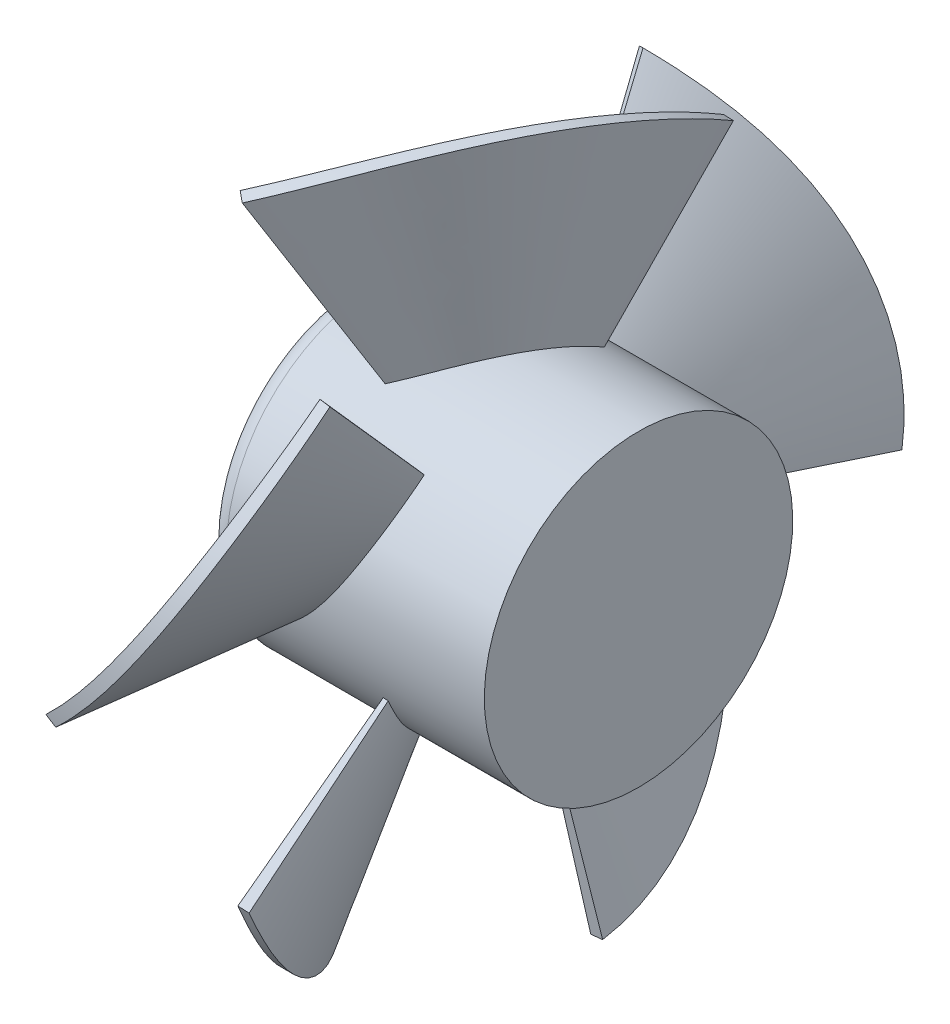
ISO-10303-21;
HEADER;
FILE_DESCRIPTION(('STEP AP214'),'2;1');
FILE_NAME('part.step','',(''),(''),'','','');
FILE_SCHEMA(('AUTOMOTIVE_DESIGN { 1 0 10303 214 1 1 1 1 }'));
ENDSEC;
DATA;
#1=APPLICATION_CONTEXT('core data for automotive mechanical design processes');
#2=APPLICATION_PROTOCOL_DEFINITION('international standard','automotive_design',2000,#1);
#3=PRODUCT_CONTEXT('',#1,'mechanical');
#4=PRODUCT('Part','Part','',(#3));
#5=PRODUCT_RELATED_PRODUCT_CATEGORY('part','',(#4));
#6=PRODUCT_DEFINITION_FORMATION('','',#4);
#7=PRODUCT_DEFINITION_CONTEXT('part definition',#1,'design');
#8=PRODUCT_DEFINITION('design','',#6,#7);
#9=PRODUCT_DEFINITION_SHAPE('','',#8);
#10=(LENGTH_UNIT() NAMED_UNIT(*) SI_UNIT(.MILLI.,.METRE.));
#11=(NAMED_UNIT(*) PLANE_ANGLE_UNIT() SI_UNIT($,.RADIAN.));
#12=(NAMED_UNIT(*) SI_UNIT($,.STERADIAN.) SOLID_ANGLE_UNIT());
#13=UNCERTAINTY_MEASURE_WITH_UNIT(LENGTH_MEASURE(1.E-05),#10,'distance_accuracy_value','');
#14=(GEOMETRIC_REPRESENTATION_CONTEXT(3) GLOBAL_UNCERTAINTY_ASSIGNED_CONTEXT((#13)) GLOBAL_UNIT_ASSIGNED_CONTEXT((#10,
#11,#12)) REPRESENTATION_CONTEXT('',''));
#15=CARTESIAN_POINT('',(0.,0.,0.));
#16=DIRECTION('',(0.,0.,1.));
#17=DIRECTION('',(1.,0.,0.));
#18=AXIS2_PLACEMENT_3D('',#15,#16,#17);
#19=CARTESIAN_POINT('',(-24.234930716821,28.,13.3168028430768));
#20=CARTESIAN_POINT('',(-14.2,0.,0.));
#21=CARTESIAN_POINT('',(-15.8931168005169,28.,5.53793552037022));
#22=CARTESIAN_POINT('',(-14.2,0.,0.));
#23=CARTESIAN_POINT('',(-10.7149051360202,28.,-4.62487709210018));
#24=CARTESIAN_POINT('',(-14.2,0.,0.));
#25=CARTESIAN_POINT('',(-9.32486447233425,28.,-15.9458498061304));
#26=CARTESIAN_POINT('',(-14.2,0.,0.));
#27=(BOUNDED_SURFACE() B_SPLINE_SURFACE(3,1,((#19,#20),(#21,#22),(#23,#24),(#25,#26)),
.UNSPECIFIED.,.F.,.F.,.F.) B_SPLINE_SURFACE_WITH_KNOTS((4,4),(2,2),(0.,1.),(0.,1.),
.UNSPECIFIED.) GEOMETRIC_REPRESENTATION_ITEM() RATIONAL_B_SPLINE_SURFACE(((1.,1.),
(0.959795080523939,0.959795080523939),(0.959795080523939,0.959795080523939),(1.,1.))) REPRESENTATION_ITEM('') SURFACE());
#28=DIRECTION('',(-0.307924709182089,0.859187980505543,0.408629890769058));
#29=VECTOR('',#28,1.);
#30=CARTESIAN_POINT('',(-19.2174653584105,14.,6.6584014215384));
#31=LINE('',#30,#29);
#32=CARTESIAN_POINT('',(-18.2456332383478,11.2883420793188,5.36873663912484));
#33=VERTEX_POINT('',#32);
#34=CARTESIAN_POINT('',(-23.2622184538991,25.285886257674,12.0259700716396));
#35=VERTEX_POINT('',#34);
#36=EDGE_CURVE('E232',#33,#35,#31,.T.);
#37=CARTESIAN_POINT('',(-23.2622184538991,25.285886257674,12.0259700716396));
#38=CARTESIAN_POINT('',(-23.0422548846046,25.3772974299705,11.8337743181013));
#39=CARTESIAN_POINT('',(-22.8248516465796,25.4676369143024,11.6381691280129));
#40=CARTESIAN_POINT('',(-22.3950643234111,25.6456931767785,11.2403685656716));
#41=CARTESIAN_POINT('',(-22.1826801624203,25.7334099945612,11.0381732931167));
#42=CARTESIAN_POINT('',(-21.5527568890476,25.9919679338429,10.4219021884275));
#43=CARTESIAN_POINT('',(-21.1425906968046,26.1581561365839,9.99826705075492));
#44=CARTESIAN_POINT('',(-20.341362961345,26.4745816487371,9.127498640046));
#45=CARTESIAN_POINT('',(-19.9503053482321,26.6248156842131,8.68036057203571));
#46=CARTESIAN_POINT('',(-19.1849766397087,26.9068714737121,7.76222060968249));
#47=CARTESIAN_POINT('',(-18.8108016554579,27.0385951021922,7.29110833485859));
#48=CARTESIAN_POINT('',(-18.0812633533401,27.2797955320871,6.32918677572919));
#49=CARTESIAN_POINT('',(-17.725896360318,27.3892766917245,5.83838137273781));
#50=CARTESIAN_POINT('',(-17.033999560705,27.5833846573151,4.83900146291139));
#51=CARTESIAN_POINT('',(-16.697466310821,27.6680160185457,4.33043023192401));
#52=CARTESIAN_POINT('',(-16.0954605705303,27.798766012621,3.37949374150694));
#53=CARTESIAN_POINT('',(-15.8271906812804,27.8488664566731,2.93944128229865));
#54=CARTESIAN_POINT('',(-15.3045308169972,27.9284768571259,2.04934342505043));
#55=CARTESIAN_POINT('',(-15.0501402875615,27.9579876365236,1.59929842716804));
#56=CARTESIAN_POINT('',(-14.5557134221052,27.9951808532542,0.69044740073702));
#57=CARTESIAN_POINT('',(-14.3156781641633,28.0028616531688,0.231640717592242));
#58=CARTESIAN_POINT('',(-13.851056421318,27.9952418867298,-0.692510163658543));
#59=CARTESIAN_POINT('',(-13.6264425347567,27.979983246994,-1.15784089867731));
#60=CARTESIAN_POINT('',(-13.1929952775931,27.9254984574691,-2.0944068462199));
#61=CARTESIAN_POINT('',(-12.9841610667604,27.8862735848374,-2.56564174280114));
#62=CARTESIAN_POINT('',(-12.5832740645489,27.7829072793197,-3.51237618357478));
#63=CARTESIAN_POINT('',(-12.3912175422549,27.7187714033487,-3.9878747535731));
#64=CARTESIAN_POINT('',(-11.9867494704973,27.5486533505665,-5.04107153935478));
#65=CARTESIAN_POINT('',(-11.7784421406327,27.4367345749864,-5.61940881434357));
#66=CARTESIAN_POINT('',(-11.3902204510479,27.1740040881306,-6.77684959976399));
#67=CARTESIAN_POINT('',(-11.2103071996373,27.0231908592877,-7.35595313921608));
#68=CARTESIAN_POINT('',(-10.881952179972,26.6821922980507,-8.51010565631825));
#69=CARTESIAN_POINT('',(-10.733444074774,26.4920916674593,-9.08516064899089));
#70=CARTESIAN_POINT('',(-10.4705994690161,26.0720734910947,-10.2282683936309));
#71=CARTESIAN_POINT('',(-10.3562449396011,25.8421770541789,-10.7963246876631));
#72=CARTESIAN_POINT('',(-10.1886892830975,25.4043741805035,-11.7827359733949));
#73=CARTESIAN_POINT('',(-10.1273636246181,25.204990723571,-12.2035123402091));
#74=CARTESIAN_POINT('',(-10.0277900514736,24.7843217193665,-13.0367063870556));
#75=CARTESIAN_POINT('',(-9.98954035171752,24.5630378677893,-13.4491247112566));
#76=CARTESIAN_POINT('',(-9.96367231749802,24.3310518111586,-13.8564034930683));
#77=B_SPLINE_CURVE_WITH_KNOTS('',3,(#37,#38,#39,#40,#41,#42,#43,#44,#45,#46,#47,#48,#49,#50,#51,
#52,#53,#54,#55,#56,#57,#58,#59,#60,#61,#62,#63,#64,#65,#66,#67,#68,#69,#70,#71,#72,#73,#74,#75,
#76),.UNSPECIFIED.,.F.,.F.,(4,2,2,2,2,2,2,2,2,2,2,2,2,2,2,2,2,2,2,4),(0.,0.918143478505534,
1.83627307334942,3.67313268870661,5.51036851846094,7.35700329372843,9.2032758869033,
11.0492098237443,12.6019814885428,14.1546910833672,15.7075171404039,17.2575085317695,
18.8074173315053,20.356980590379,22.2296047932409,24.1023020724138,25.9710032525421,
27.8387162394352,29.246559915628,30.6542946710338),.UNSPECIFIED.);
#78=CARTESIAN_POINT('',(-9.96367231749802,24.3310518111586,-13.8564034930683));
#79=VERTEX_POINT('',#78);
#80=EDGE_CURVE('E460',#35,#79,#77,.T.);
#81=DIRECTION('',(-0.14959492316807,-0.859187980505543,0.489302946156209));
#82=VECTOR('',#81,1.);
#83=CARTESIAN_POINT('',(-11.7624322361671,14.,-7.97292490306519));
#84=LINE('',#83,#82);
#85=CARTESIAN_POINT('',(-12.3087822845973,10.8620767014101,-6.18589441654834));
#86=VERTEX_POINT('',#85);
#87=EDGE_CURVE('E229',#79,#86,#84,.T.);
#88=CARTESIAN_POINT('',(-18.2456332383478,11.2883420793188,5.36873663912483));
#89=CARTESIAN_POINT('',(-18.0532775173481,11.3683095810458,5.20065802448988));
#90=CARTESIAN_POINT('',(-17.8652804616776,11.4464016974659,5.02672240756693));
#91=CARTESIAN_POINT('',(-17.4977054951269,11.5973371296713,4.66792048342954));
#92=CARTESIAN_POINT('',(-17.3181295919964,11.6701791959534,4.48305159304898));
#93=CARTESIAN_POINT('',(-16.9671689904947,11.8090853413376,4.10322447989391));
#94=CARTESIAN_POINT('',(-16.7957852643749,11.8751486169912,3.90826506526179));
#95=CARTESIAN_POINT('',(-16.4595254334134,11.9997317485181,3.50726532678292));
#96=CARTESIAN_POINT('',(-16.2947229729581,12.0581772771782,3.30114012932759));
#97=CARTESIAN_POINT('',(-15.9732194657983,12.165567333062,2.88029959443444));
#98=CARTESIAN_POINT('',(-15.8165175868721,12.2145128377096,2.66558514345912));
#99=CARTESIAN_POINT('',(-15.5112272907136,12.3017872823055,2.2283936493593));
#100=CARTESIAN_POINT('',(-15.3626387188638,12.3401164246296,2.00591675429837));
#101=CARTESIAN_POINT('',(-15.0007501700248,12.4215308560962,1.43995569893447));
#102=CARTESIAN_POINT('',(-14.7926196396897,12.4572610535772,1.09204527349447));
#103=CARTESIAN_POINT('',(-14.3958783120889,12.4991599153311,0.383438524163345));
#104=CARTESIAN_POINT('',(-14.2072707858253,12.5053236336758,0.0227400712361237));
#105=CARTESIAN_POINT('',(-13.851794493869,12.4853137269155,-0.706878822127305));
#106=CARTESIAN_POINT('',(-13.6848532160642,12.4592512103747,-1.07576673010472));
#107=CARTESIAN_POINT('',(-13.3742531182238,12.3725710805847,-1.81916018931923));
#108=CARTESIAN_POINT('',(-13.230580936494,12.3119733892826,-2.19366238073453));
#109=CARTESIAN_POINT('',(-13.0117103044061,12.1799160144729,-2.82257852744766));
#110=CARTESIAN_POINT('',(-12.9293996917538,12.1183189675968,-3.07663120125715));
#111=CARTESIAN_POINT('',(-12.7778462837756,11.9780748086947,-3.58398490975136));
#112=CARTESIAN_POINT('',(-12.7086034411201,11.8994277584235,-3.83728594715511));
#113=CARTESIAN_POINT('',(-12.5846364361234,11.725109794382,-4.34080831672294));
#114=CARTESIAN_POINT('',(-12.5298750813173,11.6294835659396,-4.59103593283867));
#115=CARTESIAN_POINT('',(-12.4361026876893,11.4211545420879,-5.08719132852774));
#116=CARTESIAN_POINT('',(-12.3970810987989,11.3084632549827,-5.3331218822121));
#117=CARTESIAN_POINT('',(-12.3538692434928,11.1361715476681,-5.67881390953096));
#118=CARTESIAN_POINT('',(-12.3425641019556,11.0833907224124,-5.78115405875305));
#119=CARTESIAN_POINT('',(-12.323205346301,10.9749134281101,-5.98452560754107));
#120=CARTESIAN_POINT('',(-12.3151501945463,10.9192183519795,-6.08555760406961));
#121=CARTESIAN_POINT('',(-12.3087822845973,10.8620767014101,-6.18589441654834));
#122=B_SPLINE_CURVE_WITH_KNOTS('',3,(#88,#89,#90,#91,#92,#93,#94,#95,#96,#97,#98,#99,#100,#101,
#102,#103,#104,#105,#106,#107,#108,#109,#110,#111,#112,#113,#114,#115,#116,#117,#118,#119,#120,
#121),.UNSPECIFIED.,.F.,.F.,(4,2,2,2,2,2,2,2,2,2,2,2,2,2,2,2,4),(0.,0.802877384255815,
1.605945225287,2.40910813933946,3.21959924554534,4.03000691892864,4.84039914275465,
6.05961094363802,7.27902668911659,8.4942498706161,9.70877274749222,10.5302253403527,
11.3516749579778,12.1709939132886,12.9897627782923,13.3367962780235,13.6836653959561),.UNSPECIFIED.);
#123=EDGE_CURVE('E455',#33,#86,#122,.T.);
#124=ORIENTED_EDGE('',*,*,#36,.T.);
#125=ORIENTED_EDGE('',*,*,#80,.T.);
#126=ORIENTED_EDGE('',*,*,#87,.T.);
#127=ORIENTED_EDGE('',*,*,#123,.F.);
#128=EDGE_LOOP('',(#124,#125,#126,#127));
#129=FACE_BOUND('',#128,.T.);
#130=ADVANCED_FACE('F34',(#129),#27,.T.);
#131=CARTESIAN_POINT('',(-8.33231832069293,28.,-15.8239804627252));
#132=DIRECTION('',(0.10512442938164,-0.50588751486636,-0.856169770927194));
#133=DIRECTION('',(0.,0.860940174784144,-0.508706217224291));
#134=AXIS2_PLACEMENT_3D('',#131,#132,#133);
#135=PLANE('',#134);
#136=ORIENTED_EDGE('',*,*,#87,.F.);
#137=CARTESIAN_POINT('',(-14.2,0.,0.));
#138=DIRECTION('',(0.10512442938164,-0.50588751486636,-0.856169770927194));
#139=DIRECTION('',(0.994459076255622,0.0534774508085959,0.0905058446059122));
#140=AXIS2_PLACEMENT_3D('',#137,#138,#139);
#141=ELLIPSE('',#140,266.35102958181,28.);
#142=CARTESIAN_POINT('',(-9.09164976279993,24.3765450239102,-13.7762132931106));
#143=VERTEX_POINT('',#142);
#144=EDGE_CURVE('E276',#79,#143,#141,.T.);
#145=ORIENTED_EDGE('',*,*,#144,.T.);
#146=DIRECTION('',(-0.179478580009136,-0.856454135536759,0.484018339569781));
#147=VECTOR('',#146,1.);
#148=CARTESIAN_POINT('',(-8.33231832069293,28.,-15.8239804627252));
#149=LINE('',#148,#147);
#150=CARTESIAN_POINT('',(-11.91948650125,10.8823861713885,-6.15009522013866));
#151=VERTEX_POINT('',#150);
#152=EDGE_CURVE('E235',#143,#151,#149,.T.);
#153=ORIENTED_EDGE('',*,*,#152,.T.);
#154=CARTESIAN_POINT('',(-14.2,0.,0.));
#155=DIRECTION('',(0.10512442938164,-0.50588751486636,-0.856169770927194));
#156=DIRECTION('',(-0.994459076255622,-0.053477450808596,-0.0905058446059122));
#157=AXIS2_PLACEMENT_3D('',#154,#155,#156);
#158=ELLIPSE('',#157,118.906709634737,12.5);
#159=EDGE_CURVE('E475',#86,#151,#158,.T.);
#160=ORIENTED_EDGE('',*,*,#159,.F.);
#161=EDGE_LOOP('',(#136,#145,#153,#160));
#162=FACE_BOUND('',#161,.T.);
#163=ADVANCED_FACE('F435',(#162),#135,.T.);
#164=CARTESIAN_POINT('',(-24.234930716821,28.,13.3168028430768));
#165=DIRECTION('',(-0.630865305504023,-0.50588751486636,0.588291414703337));
#166=DIRECTION('',(0.681998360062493,0.,0.731353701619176));
#167=AXIS2_PLACEMENT_3D('',#164,#165,#166);
#168=PLANE('',#167);
#169=DIRECTION('',(0.286084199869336,-0.856454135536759,-0.42970006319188));
#170=VECTOR('',#169,1.);
#171=CARTESIAN_POINT('',(-23.5529323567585,28.,14.048156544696));
#172=LINE('',#171,#170);
#173=CARTESIAN_POINT('',(-22.5597580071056,25.0267205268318,12.5564031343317));
#174=VERTEX_POINT('',#173);
#175=CARTESIAN_POINT('',(-17.9320348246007,11.1726430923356,5.60553711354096));
#176=VERTEX_POINT('',#175);
#177=EDGE_CURVE('E222',#174,#176,#172,.T.);
#178=ORIENTED_EDGE('',*,*,#177,.F.);
#179=CARTESIAN_POINT('',(-14.2,0.,0.));
#180=DIRECTION('',(-0.630865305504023,-0.50588751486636,0.588291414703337));
#181=DIRECTION('',(0.775892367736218,-0.41132880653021,0.478330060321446));
#182=AXIS2_PLACEMENT_3D('',#179,#180,#181);
#183=ELLIPSE('',#182,44.3834836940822,28.);
#184=EDGE_CURVE('E279',#174,#35,#183,.T.);
#185=ORIENTED_EDGE('',*,*,#184,.T.);
#186=ORIENTED_EDGE('',*,*,#36,.F.);
#187=CARTESIAN_POINT('',(-14.2,0.,0.));
#188=DIRECTION('',(-0.630865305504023,-0.50588751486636,0.588291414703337));
#189=DIRECTION('',(-0.775892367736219,0.41132880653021,-0.478330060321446));
#190=AXIS2_PLACEMENT_3D('',#187,#188,#189);
#191=ELLIPSE('',#190,19.8140552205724,12.5);
#192=EDGE_CURVE('E247',#176,#33,#191,.T.);
#193=ORIENTED_EDGE('',*,*,#192,.F.);
#194=EDGE_LOOP('',(#178,#185,#186,#193));
#195=FACE_BOUND('',#194,.T.);
#196=ADVANCED_FACE('F260',(#195),#168,.T.);
#197=CARTESIAN_POINT('',(-8.33231832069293,28.,-15.8239804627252));
#198=CARTESIAN_POINT('',(-14.2,0.,0.));
#199=CARTESIAN_POINT('',(-9.75131083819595,28.,-4.26721382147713));
#200=CARTESIAN_POINT('',(-14.2,0.,0.));
#201=CARTESIAN_POINT('',(-15.0373746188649,28.,6.10727048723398));
#202=CARTESIAN_POINT('',(-14.2,0.,0.));
#203=CARTESIAN_POINT('',(-23.5529323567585,28.,14.048156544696));
#204=CARTESIAN_POINT('',(-14.2,0.,0.));
#205=(BOUNDED_SURFACE() B_SPLINE_SURFACE(3,1,((#197,#198),(#199,#200),(#201,#202),(#203,#204)),
.UNSPECIFIED.,.F.,.F.,.F.) B_SPLINE_SURFACE_WITH_KNOTS((4,4),(2,2),(0.,1.),(0.,1.),
.UNSPECIFIED.) GEOMETRIC_REPRESENTATION_ITEM() RATIONAL_B_SPLINE_SURFACE(((1.,1.),
(0.959795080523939,0.959795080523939),(0.959795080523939,0.959795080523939),(1.,1.))) REPRESENTATION_ITEM('') SURFACE());
#206=CARTESIAN_POINT('',(-9.09164976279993,24.3765450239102,-13.7762132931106));
#207=CARTESIAN_POINT('',(-9.10157355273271,24.5052370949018,-13.5485016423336));
#208=CARTESIAN_POINT('',(-9.11539911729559,24.6306439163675,-13.3191434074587));
#209=CARTESIAN_POINT('',(-9.15056806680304,24.8747520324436,-12.8574830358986));
#210=CARTESIAN_POINT('',(-9.17191067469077,24.9934540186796,-12.6251812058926));
#211=CARTESIAN_POINT('',(-9.24674602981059,25.3391365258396,-11.9247234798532));
#212=CARTESIAN_POINT('',(-9.31106475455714,25.5559201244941,-11.4526141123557));
#213=CARTESIAN_POINT('',(-9.46605943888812,25.9606290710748,-10.5029128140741));
#214=CARTESIAN_POINT('',(-9.55662416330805,26.1486711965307,-10.0253520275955));
#215=CARTESIAN_POINT('',(-9.76225171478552,26.4968302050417,-9.06525252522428));
#216=CARTESIAN_POINT('',(-9.87732021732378,26.65694060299,-8.58271268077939));
#217=CARTESIAN_POINT('',(-10.1447956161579,26.9662602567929,-7.55902702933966));
#218=CARTESIAN_POINT('',(-10.299985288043,27.1120510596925,-7.01757540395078));
#219=CARTESIAN_POINT('',(-10.6363387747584,27.3695136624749,-5.93460995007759));
#220=CARTESIAN_POINT('',(-10.8175060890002,27.481180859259,-5.39309612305));
#221=CARTESIAN_POINT('',(-11.2040463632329,27.6714119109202,-4.31213500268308));
#222=CARTESIAN_POINT('',(-11.4094499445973,27.7499333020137,-3.77269123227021));
#223=CARTESIAN_POINT('',(-11.8425308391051,27.8748479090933,-2.69907168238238));
#224=CARTESIAN_POINT('',(-12.0702094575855,27.921239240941,-2.1648962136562));
#225=CARTESIAN_POINT('',(-12.5899706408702,27.9889485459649,-1.00690867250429));
#226=CARTESIAN_POINT('',(-12.8862115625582,28.0041182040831,-0.38459795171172));
#227=CARTESIAN_POINT('',(-13.5057689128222,27.9939805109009,0.846052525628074));
#228=CARTESIAN_POINT('',(-13.8290882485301,27.9686688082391,1.4543907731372));
#229=CARTESIAN_POINT('',(-14.5016003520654,27.880378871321,2.65460833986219));
#230=CARTESIAN_POINT('',(-14.8508208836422,27.8173596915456,3.24646903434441));
#231=CARTESIAN_POINT('',(-15.5737477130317,27.6567369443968,4.41020141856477));
#232=CARTESIAN_POINT('',(-15.9474544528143,27.5591327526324,4.98207274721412));
#233=CARTESIAN_POINT('',(-16.6354187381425,27.3571944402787,5.98205946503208));
#234=CARTESIAN_POINT('',(-16.9450993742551,27.2588593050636,6.41456285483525));
#235=CARTESIAN_POINT('',(-17.5790329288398,27.0447847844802,7.26440781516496));
#236=CARTESIAN_POINT('',(-17.9032875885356,26.9290433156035,7.68174756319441));
#237=CARTESIAN_POINT('',(-18.5663853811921,26.6820664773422,8.49999853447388));
#238=CARTESIAN_POINT('',(-18.9052302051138,26.5508293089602,8.90090784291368));
#239=CARTESIAN_POINT('',(-19.5966681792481,26.2753447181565,9.68390689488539));
#240=CARTESIAN_POINT('',(-19.9492199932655,26.1311349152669,10.0660463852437));
#241=CARTESIAN_POINT('',(-20.6691994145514,25.8316522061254,10.8114236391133));
#242=CARTESIAN_POINT('',(-21.0366252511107,25.6763806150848,11.1746636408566));
#243=CARTESIAN_POINT('',(-21.7866800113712,25.3573170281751,11.8809583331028));
#244=CARTESIAN_POINT('',(-22.1693054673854,25.1935269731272,12.2240175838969));
#245=CARTESIAN_POINT('',(-22.5597580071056,25.0267205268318,12.5564031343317));
#246=B_SPLINE_CURVE_WITH_KNOTS('',3,(#206,#207,#208,#209,#210,#211,#212,#213,#214,#215,#216,
#217,#218,#219,#220,#221,#222,#223,#224,#225,#226,#227,#228,#229,#230,#231,#232,#233,#234,#235,
#236,#237,#238,#239,#240,#241,#242,#243,#244,#245),.UNSPECIFIED.,.F.,.F.,(4,2,2,2,2,2,2,2,2,2,2,
2,2,2,2,2,2,2,2,4),(0.,0.78512882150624,1.57017650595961,3.138892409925,4.70105469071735,
6.26357918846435,8.00733945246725,9.75133483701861,11.4975577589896,13.2438830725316,
15.3100471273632,17.3764332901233,19.4450673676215,21.5137387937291,23.1359369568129,
24.7583294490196,26.3809104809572,27.9989291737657,29.6167558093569,31.2342154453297),.UNSPECIFIED.);
#247=EDGE_CURVE('E49',#143,#174,#246,.T.);
#248=CARTESIAN_POINT('',(-11.91948650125,10.8823861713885,-6.15009522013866));
#249=CARTESIAN_POINT('',(-11.92500361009,10.953916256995,-6.02353003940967));
#250=CARTESIAN_POINT('',(-11.9332185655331,11.0231678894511,-5.89583054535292));
#251=CARTESIAN_POINT('',(-11.9548005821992,11.1570039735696,-5.63846510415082));
#252=CARTESIAN_POINT('',(-11.9681666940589,11.2215892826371,-5.50879952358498));
#253=CARTESIAN_POINT('',(-12.015585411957,11.4080389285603,-5.11761321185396));
#254=CARTESIAN_POINT('',(-12.0569757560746,11.5228041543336,-4.85353568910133));
#255=CARTESIAN_POINT('',(-12.1571245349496,11.7320734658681,-4.3231015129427));
#256=CARTESIAN_POINT('',(-12.2157531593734,11.826720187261,-4.05677584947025));
#257=CARTESIAN_POINT('',(-12.3489092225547,11.9968676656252,-3.52192204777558));
#258=CARTESIAN_POINT('',(-12.4234414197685,12.0723626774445,-3.25339327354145));
#259=CARTESIAN_POINT('',(-12.5865493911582,12.2041344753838,-2.71751016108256));
#260=CARTESIAN_POINT('',(-12.6750513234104,12.2605076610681,-2.45015684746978));
#261=CARTESIAN_POINT('',(-12.8651592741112,12.3551145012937,-1.91689542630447));
#262=CARTESIAN_POINT('',(-12.9667668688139,12.3933459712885,-1.65098749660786));
#263=CARTESIAN_POINT('',(-13.1822215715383,12.4524238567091,-1.12168664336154));
#264=CARTESIAN_POINT('',(-13.296090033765,12.4732393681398,-0.858299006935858));
#265=CARTESIAN_POINT('',(-13.5350411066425,12.4982237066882,-0.33586677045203));
#266=CARTESIAN_POINT('',(-13.6601244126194,12.502391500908,-0.0768224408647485));
#267=CARTESIAN_POINT('',(-13.9363667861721,12.4945928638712,0.466319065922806));
#268=CARTESIAN_POINT('',(-14.0888557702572,12.4806392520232,0.749711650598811));
#269=CARTESIAN_POINT('',(-14.4062278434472,12.4345377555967,1.30794592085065));
#270=CARTESIAN_POINT('',(-14.5711120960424,12.402388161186,1.58278680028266));
#271=CARTESIAN_POINT('',(-14.9127561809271,12.3215085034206,2.12247077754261));
#272=CARTESIAN_POINT('',(-15.0895168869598,12.272777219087,2.38731313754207));
#273=CARTESIAN_POINT('',(-15.4546061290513,12.1605015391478,2.90559618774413));
#274=CARTESIAN_POINT('',(-15.6429335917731,12.0969585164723,3.15903793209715));
#275=CARTESIAN_POINT('',(-15.9960457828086,11.9696464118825,3.60858134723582));
#276=CARTESIAN_POINT('',(-16.1589421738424,11.907989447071,3.8067741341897));
#277=CARTESIAN_POINT('',(-16.4925316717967,11.7772227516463,4.19389603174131));
#278=CARTESIAN_POINT('',(-16.66322404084,11.7081137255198,4.38282601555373));
#279=CARTESIAN_POINT('',(-17.0121778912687,11.5638850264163,4.75030457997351));
#280=CARTESIAN_POINT('',(-17.1904218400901,11.4887789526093,4.92887514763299));
#281=CARTESIAN_POINT('',(-17.5550630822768,11.3338693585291,5.27537514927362));
#282=CARTESIAN_POINT('',(-17.7414612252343,11.2540653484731,5.44330346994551));
#283=CARTESIAN_POINT('',(-17.9320348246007,11.1726430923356,5.60553711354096));
#284=B_SPLINE_CURVE_WITH_KNOTS('',3,(#248,#249,#250,#251,#252,#253,#254,#255,#256,#257,#258,
#259,#260,#261,#262,#263,#264,#265,#266,#267,#268,#269,#270,#271,#272,#273,#274,#275,#276,#277,
#278,#279,#280,#281,#282,#283),.UNSPECIFIED.,.F.,.F.,(4,2,2,2,2,2,2,2,2,2,2,2,2,2,2,2,2,4),(0.,
0.436349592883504,0.872618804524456,1.74389675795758,2.60877475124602,3.47391188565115,
4.33462039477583,5.1954325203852,6.05776890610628,6.92015879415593,7.88558531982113,
8.85110257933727,9.81669094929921,10.7821898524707,11.5733717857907,12.3644789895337,
13.1538405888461,13.9432846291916),.UNSPECIFIED.);
#285=EDGE_CURVE('E240',#151,#176,#284,.T.);
#286=ORIENTED_EDGE('',*,*,#152,.F.);
#287=ORIENTED_EDGE('',*,*,#247,.T.);
#288=ORIENTED_EDGE('',*,*,#177,.T.);
#289=ORIENTED_EDGE('',*,*,#285,.F.);
#290=EDGE_LOOP('',(#286,#287,#288,#289));
#291=FACE_BOUND('',#290,.T.);
#292=ADVANCED_FACE('F252',(#291),#205,.T.);
#293=CARTESIAN_POINT('',(-24.234930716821,-4.01255627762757,30.7447008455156));
#294=CARTESIAN_POINT('',(-14.2,0.,0.));
#295=CARTESIAN_POINT('',(-15.8931168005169,3.38558617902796,28.3408986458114));
#296=CARTESIAN_POINT('',(-14.2,0.,0.));
#297=CARTESIAN_POINT('',(-10.7149051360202,13.0509953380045,25.20041683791));
#298=CARTESIAN_POINT('',(-14.2,0.,0.));
#299=CARTESIAN_POINT('',(-9.32486447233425,23.8178802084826,21.7020438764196));
#300=CARTESIAN_POINT('',(-14.2,0.,0.));
#301=(BOUNDED_SURFACE() B_SPLINE_SURFACE(3,1,((#293,#294),(#295,#296),(#297,#298),(#299,#300)),
.UNSPECIFIED.,.F.,.F.,.F.) B_SPLINE_SURFACE_WITH_KNOTS((4,4),(2,2),(0.,1.),(0.,1.),
.UNSPECIFIED.) GEOMETRIC_REPRESENTATION_ITEM() RATIONAL_B_SPLINE_SURFACE(((1.,1.),
(0.959795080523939,0.959795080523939),(0.959795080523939,0.959795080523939),(1.,1.))) REPRESENTATION_ITEM('') SURFACE());
#302=DIRECTION('',(-0.307924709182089,-0.123126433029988,0.943409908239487));
#303=VECTOR('',#302,1.);
#304=CARTESIAN_POINT('',(-19.2174653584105,-2.00627813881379,15.3723504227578));
#305=LINE('',#304,#303);
#306=CARTESIAN_POINT('',(-18.2456332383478,-1.61768242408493,12.3948821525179));
#307=VERTEX_POINT('',#306);
#308=CARTESIAN_POINT('',(-23.2622184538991,-3.62360862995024,27.7645360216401));
#309=VERTEX_POINT('',#308);
#310=EDGE_CURVE('E223',#307,#309,#305,.T.);
#311=CARTESIAN_POINT('',(-23.2622184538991,-3.62360862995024,27.7645360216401));
#312=CARTESIAN_POINT('',(-23.0422548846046,-3.41257200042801,27.7920814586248));
#313=CARTESIAN_POINT('',(-22.8248516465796,-3.19862397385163,27.8175540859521));
#314=CARTESIAN_POINT('',(-22.3950643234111,-2.76527074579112,27.8639685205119));
#315=CARTESIAN_POINT('',(-22.1826801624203,-2.5458656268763,27.884910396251));
#316=CARTESIAN_POINT('',(-21.5527568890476,-1.87985817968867,27.9403753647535));
#317=CARTESIAN_POINT('',(-21.1425906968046,-1.42560224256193,27.9675192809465));
#318=CARTESIAN_POINT('',(-20.3413629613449,-0.499671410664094,27.999375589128));
#319=CARTESIAN_POINT('',(-19.9503053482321,-0.0279929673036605,28.0040833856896));
#320=CARTESIAN_POINT('',(-19.1849766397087,0.932370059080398,27.9886135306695));
#321=CARTESIAN_POINT('',(-18.8108016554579,1.42112929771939,27.9683084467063));
#322=CARTESIAN_POINT('',(-18.0812633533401,2.41050609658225,27.9004535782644));
#323=CARTESIAN_POINT('',(-17.725896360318,2.91112131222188,27.8529091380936));
#324=CARTESIAN_POINT('',(-17.033999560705,3.92157074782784,27.7286914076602));
#325=CARTESIAN_POINT('',(-16.697466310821,4.43140325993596,27.6520234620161));
#326=CARTESIAN_POINT('',(-16.0954605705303,5.37620157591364,27.4825185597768));
#327=CARTESIAN_POINT('',(-15.8271906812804,5.81019822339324,27.3941832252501));
#328=CARTESIAN_POINT('',(-15.3045308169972,6.68133255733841,27.1948418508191));
#329=CARTESIAN_POINT('',(-15.0501402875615,7.11847011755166,27.0838367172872));
#330=CARTESIAN_POINT('',(-14.5557134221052,7.99433214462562,26.8383591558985));
#331=CARTESIAN_POINT('',(-14.3156781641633,8.43305672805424,26.7038849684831));
#332=CARTESIAN_POINT('',(-13.851056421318,9.3096218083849,26.4110598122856));
#333=CARTESIAN_POINT('',(-13.6264425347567,9.7474624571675,26.2527528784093));
#334=CARTESIAN_POINT('',(-13.1929952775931,10.6213528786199,25.9115199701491));
#335=CARTESIAN_POINT('',(-12.9841610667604,11.0574027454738,25.7285953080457));
#336=CARTESIAN_POINT('',(-12.5832740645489,11.9258587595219,25.3377310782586));
#337=CARTESIAN_POINT('',(-12.3912175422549,12.3582656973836,25.1297970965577));
#338=CARTESIAN_POINT('',(-11.9867494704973,13.3073459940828,24.6425495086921));
#339=CARTESIAN_POINT('',(-11.7784421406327,13.8227926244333,24.3573923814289));
#340=CARTESIAN_POINT('',(-11.3902204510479,14.8423960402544,23.7498519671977));
#341=CARTESIAN_POINT('',(-11.2103071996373,15.3465523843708,23.4274672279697));
#342=CARTESIAN_POINT('',(-10.881952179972,16.3388423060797,22.7465055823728));
#343=CARTESIAN_POINT('',(-10.733444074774,16.8270077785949,22.3880073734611));
#344=CARTESIAN_POINT('',(-10.4705994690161,17.7843750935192,21.6353066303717));
#345=CARTESIAN_POINT('',(-10.3562449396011,18.2535868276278,21.2411230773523));
#346=CARTESIAN_POINT('',(-10.1886892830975,19.0564311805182,20.5199299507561));
#347=CARTESIAN_POINT('',(-10.1273636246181,19.3950004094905,20.2002779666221));
#348=CARTESIAN_POINT('',(-10.0277900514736,20.0574211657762,19.5427268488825));
#349=CARTESIAN_POINT('',(-9.98954035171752,20.381273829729,19.2048291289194));
#350=CARTESIAN_POINT('',(-9.96367231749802,20.6969313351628,18.858341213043));
#351=B_SPLINE_CURVE_WITH_KNOTS('',3,(#311,#312,#313,#314,#315,#316,#317,#318,#319,#320,#321,
#322,#323,#324,#325,#326,#327,#328,#329,#330,#331,#332,#333,#334,#335,#336,#337,#338,#339,#340,
#341,#342,#343,#344,#345,#346,#347,#348,#349,#350),.UNSPECIFIED.,.F.,.F.,(4,2,2,2,2,2,2,2,2,2,2,
2,2,2,2,2,2,2,2,4),(0.,0.918143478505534,1.83627307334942,3.67313268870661,5.51036851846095,
7.35700329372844,9.20327588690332,11.0492098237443,12.6019814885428,14.1546910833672,
15.7075171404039,17.2575085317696,18.8074173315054,20.3569805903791,22.2296047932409,
24.1023020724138,25.9710032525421,27.8387162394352,29.246559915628,30.6542946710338),.UNSPECIFIED.);
#352=CARTESIAN_POINT('',(-9.96367231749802,20.6969313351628,18.858341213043));
#353=VERTEX_POINT('',#352);
#354=EDGE_CURVE('E344',#309,#353,#351,.T.);
#355=DIRECTION('',(-0.14959492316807,-0.730858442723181,-0.665933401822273));
#356=VECTOR('',#355,1.);
#357=CARTESIAN_POINT('',(-11.7624322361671,11.9089401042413,10.8510219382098));
#358=LINE('',#357,#356);
#359=CARTESIAN_POINT('',(-12.3087822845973,9.23970148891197,8.41890232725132));
#360=VERTEX_POINT('',#359);
#361=EDGE_CURVE('E220',#353,#360,#358,.T.);
#362=CARTESIAN_POINT('',(-18.2456332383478,-1.61768242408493,12.3948821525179));
#363=CARTESIAN_POINT('',(-18.0532775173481,-1.43311884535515,12.418996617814));
#364=CARTESIAN_POINT('',(-17.8652804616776,-1.24356445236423,12.4395175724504));
#365=CARTESIAN_POINT('',(-17.4977054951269,-0.855681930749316,12.4721898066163));
#366=CARTESIAN_POINT('',(-17.3181295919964,-0.657351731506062,12.4843390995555));
#367=CARTESIAN_POINT('',(-16.9671689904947,-0.253190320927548,12.4990736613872));
#368=CARTESIAN_POINT('',(-16.7957852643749,-0.047358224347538,12.5016577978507));
#369=CARTESIAN_POINT('',(-16.4595254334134,0.37251349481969,12.4962276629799));
#370=CARTESIAN_POINT('',(-16.2947229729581,0.586610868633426,12.4881164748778));
#371=CARTESIAN_POINT('',(-15.9732194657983,1.02003935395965,12.4602036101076));
#372=CARTESIAN_POINT('',(-15.8165175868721,1.23936992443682,12.4404031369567));
#373=CARTESIAN_POINT('',(-15.5112272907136,1.68213303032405,12.3883064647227));
#374=CARTESIAN_POINT('',(-15.3626387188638,1.90556548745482,12.3560105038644));
#375=CARTESIAN_POINT('',(-15.0007501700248,2.4689848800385,12.2585486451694));
#376=CARTESIAN_POINT('',(-14.7926196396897,2.81090859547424,12.1850198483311));
#377=CARTESIAN_POINT('',(-14.3958783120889,3.49778112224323,12.0058965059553));
#378=CARTESIAN_POINT('',(-14.2072707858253,3.84273043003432,11.9002965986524));
#379=CARTESIAN_POINT('',(-13.851794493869,4.53045583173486,11.6558014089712));
#380=CARTESIAN_POINT('',(-13.6848532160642,4.87323531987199,11.5170218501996));
#381=CARTESIAN_POINT('',(-13.3742531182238,5.5534588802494,11.204862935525));
#382=CARTESIAN_POINT('',(-13.230580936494,5.89090591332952,11.0315035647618));
#383=CARTESIAN_POINT('',(-13.0117103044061,6.44823273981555,10.7115637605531));
#384=CARTESIAN_POINT('',(-12.9293996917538,6.67081665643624,10.5744748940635));
#385=CARTESIAN_POINT('',(-12.7778462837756,7.11000087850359,10.2843138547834));
#386=CARTESIAN_POINT('',(-12.7086034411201,7.32660120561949,10.131241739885));
#387=CARTESIAN_POINT('',(-12.5846364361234,7.75161222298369,9.80985853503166));
#388=CARTESIAN_POINT('',(-12.5298750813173,7.96004269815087,9.64158800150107));
#389=CARTESIAN_POINT('',(-12.4361026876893,8.36753731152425,9.29013487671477));
#390=CARTESIAN_POINT('',(-12.3970810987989,8.56660764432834,9.10696237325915));
#391=CARTESIAN_POINT('',(-12.3538692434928,8.84213923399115,8.83627851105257));
#392=CARTESIAN_POINT('',(-12.3425641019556,8.92316032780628,8.75445611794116));
#393=CARTESIAN_POINT('',(-12.323205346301,9.08305683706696,8.58844281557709));
#394=CARTESIAN_POINT('',(-12.3151501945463,9.16193325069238,8.5042530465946));
#395=CARTESIAN_POINT('',(-12.3087822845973,9.23970148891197,8.41890232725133));
#396=B_SPLINE_CURVE_WITH_KNOTS('',3,(#362,#363,#364,#365,#366,#367,#368,#369,#370,#371,#372,
#373,#374,#375,#376,#377,#378,#379,#380,#381,#382,#383,#384,#385,#386,#387,#388,#389,#390,#391,
#392,#393,#394,#395),.UNSPECIFIED.,.F.,.F.,(4,2,2,2,2,2,2,2,2,2,2,2,2,2,2,2,4),(0.,
0.802877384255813,1.605945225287,2.40910813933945,3.21959924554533,4.03000691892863,
4.84039914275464,6.059610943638,7.27902668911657,8.49424987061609,9.7087727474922,
10.5302253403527,11.3516749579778,12.1709939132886,12.9897627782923,13.3367962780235,
13.6836653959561),.UNSPECIFIED.);
#397=EDGE_CURVE('E371',#307,#360,#396,.T.);
#398=ORIENTED_EDGE('',*,*,#310,.T.);
#399=ORIENTED_EDGE('',*,*,#354,.T.);
#400=ORIENTED_EDGE('',*,*,#361,.T.);
#401=ORIENTED_EDGE('',*,*,#397,.F.);
#402=EDGE_LOOP('',(#398,#399,#400,#401));
#403=FACE_BOUND('',#402,.T.);
#404=ADVANCED_FACE('F259',(#403),#301,.T.);
#405=CARTESIAN_POINT('',(-8.33231832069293,23.7019755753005,21.7397035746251));
#406=DIRECTION('',(0.105124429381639,0.657938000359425,-0.74569862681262));
#407=DIRECTION('',(0.,0.749853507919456,0.661603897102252));
#408=AXIS2_PLACEMENT_3D('',#405,#406,#407);
#409=PLANE('',#408);
#410=ORIENTED_EDGE('',*,*,#361,.F.);
#411=CARTESIAN_POINT('',(-14.2,0.,0.));
#412=DIRECTION('',(0.105124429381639,0.657938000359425,-0.74569862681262));
#413=DIRECTION('',(0.994459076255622,-0.0695507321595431,0.0788279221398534));
#414=AXIS2_PLACEMENT_3D('',#411,#412,#413);
#415=ELLIPSE('',#414,266.351029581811,28.);
#416=CARTESIAN_POINT('',(-9.09164976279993,20.634724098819,18.9263879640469));
#417=VERTEX_POINT('',#416);
#418=EDGE_CURVE('E277',#353,#417,#415,.T.);
#419=ORIENTED_EDGE('',*,*,#418,.T.);
#420=DIRECTION('',(-0.179478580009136,-0.724987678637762,-0.664966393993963));
#421=VECTOR('',#420,1.);
#422=CARTESIAN_POINT('',(-8.33231832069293,23.7019755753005,21.7397035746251));
#423=LINE('',#422,#421);
#424=CARTESIAN_POINT('',(-11.91948650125,9.21193040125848,8.44928034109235));
#425=VERTEX_POINT('',#424);
#426=EDGE_CURVE('E226',#417,#425,#423,.T.);
#427=ORIENTED_EDGE('',*,*,#426,.T.);
#428=CARTESIAN_POINT('',(-14.2,0.,0.));
#429=DIRECTION('',(0.105124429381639,0.657938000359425,-0.74569862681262));
#430=DIRECTION('',(-0.994459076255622,0.069550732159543,-0.0788279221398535));
#431=AXIS2_PLACEMENT_3D('',#428,#429,#430);
#432=ELLIPSE('',#431,118.906709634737,12.5);
#433=EDGE_CURVE('E379',#360,#425,#432,.T.);
#434=ORIENTED_EDGE('',*,*,#433,.F.);
#435=EDGE_LOOP('',(#410,#419,#427,#434));
#436=FACE_BOUND('',#435,.T.);
#437=ADVANCED_FACE('F356',(#436),#409,.T.);
#438=CARTESIAN_POINT('',(-24.234930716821,-4.01255627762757,30.7447008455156));
#439=DIRECTION('',(-0.630865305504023,-0.715826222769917,-0.299335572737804));
#440=DIRECTION('',(0.681998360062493,-0.695558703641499,0.226000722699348));
#441=AXIS2_PLACEMENT_3D('',#438,#439,#440);
#442=PLANE('',#441);
#443=DIRECTION('',(0.286084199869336,0.144010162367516,-0.947320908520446));
#444=VECTOR('',#443,1.);
#445=CARTESIAN_POINT('',(-23.5529323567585,-4.70811498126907,30.970701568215));
#446=LINE('',#445,#444);
#447=CARTESIAN_POINT('',(-22.5597580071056,-4.20816706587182,27.6819675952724));
#448=VERTEX_POINT('',#447);
#449=CARTESIAN_POINT('',(-17.9320348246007,-1.87864601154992,12.3580212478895));
#450=VERTEX_POINT('',#449);
#451=EDGE_CURVE('E213',#448,#450,#446,.T.);
#452=ORIENTED_EDGE('',*,*,#451,.F.);
#453=CARTESIAN_POINT('',(-14.2,0.,0.));
#454=DIRECTION('',(-0.630865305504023,-0.715826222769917,-0.299335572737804));
#455=DIRECTION('',(0.775892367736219,-0.582026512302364,-0.243384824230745));
#456=AXIS2_PLACEMENT_3D('',#453,#454,#455);
#457=ELLIPSE('',#456,44.3834836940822,28.);
#458=EDGE_CURVE('E350',#448,#309,#457,.T.);
#459=ORIENTED_EDGE('',*,*,#458,.T.);
#460=ORIENTED_EDGE('',*,*,#310,.F.);
#461=CARTESIAN_POINT('',(-14.2,0.,0.));
#462=DIRECTION('',(-0.630865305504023,-0.715826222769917,-0.299335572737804));
#463=DIRECTION('',(-0.775892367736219,0.582026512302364,0.243384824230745));
#464=AXIS2_PLACEMENT_3D('',#461,#462,#463);
#465=ELLIPSE('',#464,19.8140552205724,12.5);
#466=EDGE_CURVE('E493',#450,#307,#465,.T.);
#467=ORIENTED_EDGE('',*,*,#466,.F.);
#468=EDGE_LOOP('',(#452,#459,#460,#467));
#469=FACE_BOUND('',#468,.T.);
#470=ADVANCED_FACE('F499',(#469),#442,.T.);
#471=CARTESIAN_POINT('',(-8.33231832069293,23.7019755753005,21.7397035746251));
#472=CARTESIAN_POINT('',(-14.2,0.,0.));
#473=CARTESIAN_POINT('',(-9.75131083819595,12.710837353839,25.3109408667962));
#474=CARTESIAN_POINT('',(-14.2,0.,0.));
#475=CARTESIAN_POINT('',(-15.0373746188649,2.84411644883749,28.5168328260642));
#476=CARTESIAN_POINT('',(-14.2,0.,0.));
#477=CARTESIAN_POINT('',(-23.5529323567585,-4.70811498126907,30.970701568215));
#478=CARTESIAN_POINT('',(-14.2,0.,0.));
#479=(BOUNDED_SURFACE() B_SPLINE_SURFACE(3,1,((#471,#472),(#473,#474),(#475,#476),(#477,#478)),
.UNSPECIFIED.,.F.,.F.,.F.) B_SPLINE_SURFACE_WITH_KNOTS((4,4),(2,2),(0.,1.),(0.,1.),
.UNSPECIFIED.) GEOMETRIC_REPRESENTATION_ITEM() RATIONAL_B_SPLINE_SURFACE(((1.,1.),
(0.959795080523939,0.959795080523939),(0.959795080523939,0.959795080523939),(1.,1.))) REPRESENTATION_ITEM('') SURFACE());
#480=CARTESIAN_POINT('',(-9.09164976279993,20.634724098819,18.9263879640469));
#481=CARTESIAN_POINT('',(-9.10157355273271,20.4579254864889,19.1191481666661));
#482=CARTESIAN_POINT('',(-9.1153991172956,20.2785456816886,19.3092927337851));
#483=CARTESIAN_POINT('',(-9.15056806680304,19.9149141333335,19.6841142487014));
#484=CARTESIAN_POINT('',(-9.17191067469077,19.730662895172,19.8687917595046));
#485=CARTESIAN_POINT('',(-9.24674602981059,19.1713097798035,20.4140087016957));
#486=CARTESIAN_POINT('',(-9.31106475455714,18.789296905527,20.7660719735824));
#487=CARTESIAN_POINT('',(-9.46605943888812,18.0111392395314,21.4444468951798));
#488=CARTESIAN_POINT('',(-9.55662416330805,17.6150601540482,21.7708599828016));
#489=CARTESIAN_POINT('',(-9.76225171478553,16.8095383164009,22.3986659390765));
#490=CARTESIAN_POINT('',(-9.87732021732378,16.4000924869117,22.7000529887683));
#491=CARTESIAN_POINT('',(-10.1447956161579,15.5220946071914,23.3105697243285));
#492=CARTESIAN_POINT('',(-10.299985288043,15.0521953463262,23.6165427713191));
#493=CARTESIAN_POINT('',(-10.6363387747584,14.1017943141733,24.1960589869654));
#494=CARTESIAN_POINT('',(-10.8175060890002,13.6212911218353,24.4695977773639));
#495=CARTESIAN_POINT('',(-11.2040463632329,12.6520206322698,24.9845536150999));
#496=CARTESIAN_POINT('',(-11.4094499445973,12.1632435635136,25.2259291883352));
#497=CARTESIAN_POINT('',(-11.8425308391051,11.1807714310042,25.6764967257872));
#498=CARTESIAN_POINT('',(-12.0702094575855,10.6870760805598,25.8856868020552));
#499=CARTESIAN_POINT('',(-12.5899706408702,9.60668780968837,26.3079200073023));
#500=CARTESIAN_POINT('',(-12.8862115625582,9.01952282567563,26.5146517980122));
#501=CARTESIAN_POINT('',(-13.5057689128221,7.84597195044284,26.8853021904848));
#502=CARTESIAN_POINT('',(-13.8290882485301,7.25958614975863,27.0492161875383));
#503=CARTESIAN_POINT('',(-14.5016003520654,6.09082832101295,27.3361350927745));
#504=CARTESIAN_POINT('',(-14.8508208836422,5.50846135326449,27.4590953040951));
#505=CARTESIAN_POINT('',(-15.5737477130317,4.35205092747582,27.6659470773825));
#506=CARTESIAN_POINT('',(-15.9474544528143,3.77800761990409,27.7498379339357));
#507=CARTESIAN_POINT('',(-16.6354187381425,2.76456136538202,27.8667960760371));
#508=CARTESIAN_POINT('',(-16.9450993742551,2.32283897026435,27.9069247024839));
#509=CARTESIAN_POINT('',(-17.5790329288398,1.44843571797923,27.9659442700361));
#510=CARTESIAN_POINT('',(-17.9032875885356,1.01575595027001,27.9848326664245));
#511=CARTESIAN_POINT('',(-18.5663853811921,0.161232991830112,28.0027971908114));
#512=CARTESIAN_POINT('',(-18.9052302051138,-0.260608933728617,28.0018710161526));
#513=CARTESIAN_POINT('',(-19.5966681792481,-1.09041470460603,27.9818296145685));
#514=CARTESIAN_POINT('',(-19.9492199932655,-1.49841423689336,27.9627655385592));
#515=CARTESIAN_POINT('',(-20.6691994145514,-2.29985537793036,27.9082747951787));
#516=CARTESIAN_POINT('',(-21.0366252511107,-2.69329870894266,27.8728500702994));
#517=CARTESIAN_POINT('',(-21.7866800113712,-3.4636209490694,27.7876596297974));
#518=CARTESIAN_POINT('',(-22.1693054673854,-3.84050359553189,27.7378971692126));
#519=CARTESIAN_POINT('',(-22.5597580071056,-4.20816706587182,27.6819675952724));
#520=B_SPLINE_CURVE_WITH_KNOTS('',3,(#480,#481,#482,#483,#484,#485,#486,#487,#488,#489,#490,
#491,#492,#493,#494,#495,#496,#497,#498,#499,#500,#501,#502,#503,#504,#505,#506,#507,#508,#509,
#510,#511,#512,#513,#514,#515,#516,#517,#518,#519),.UNSPECIFIED.,.F.,.F.,(4,2,2,2,2,2,2,2,2,2,2,
2,2,2,2,2,2,2,2,4),(0.,0.785128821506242,1.57017650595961,3.138892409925,4.70105469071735,
6.26357918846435,8.00733945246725,9.7513348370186,11.4975577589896,13.2438830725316,
15.3100471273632,17.3764332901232,19.4450673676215,21.5137387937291,23.1359369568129,
24.7583294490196,26.3809104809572,27.9989291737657,29.6167558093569,31.2342154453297),.UNSPECIFIED.);
#521=EDGE_CURVE('E57',#417,#448,#520,.T.);
#522=CARTESIAN_POINT('',(-11.91948650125,9.21193040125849,8.44928034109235));
#523=CARTESIAN_POINT('',(-11.92500361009,9.1136637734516,8.55642028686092));
#524=CARTESIAN_POINT('',(-11.9332185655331,9.01361426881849,8.661743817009));
#525=CARTESIAN_POINT('',(-11.9548005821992,8.81020281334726,8.86855979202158));
#526=CARTESIAN_POINT('',(-11.9681666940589,8.70684147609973,8.97005293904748));
#527=CARTESIAN_POINT('',(-12.015585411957,8.39241729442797,9.26826030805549));
#528=CARTESIAN_POINT('',(-12.0569757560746,8.17672905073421,9.45901296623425));
#529=CARTESIAN_POINT('',(-12.1571245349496,7.73692394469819,9.82195308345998));
#530=CARTESIAN_POINT('',(-12.2157531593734,7.51288063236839,9.99426662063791));
#531=CARTESIAN_POINT('',(-12.3489092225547,7.05678290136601,10.3213654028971));
#532=CARTESIAN_POINT('',(-12.4234414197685,6.82472610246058,10.4761453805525));
#533=CARTESIAN_POINT('',(-12.5865493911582,6.35579070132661,10.767064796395));
#534=CARTESIAN_POINT('',(-12.6750513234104,6.11894286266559,10.9032955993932));
#535=CARTESIAN_POINT('',(-12.8651592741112,5.64101623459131,11.1580588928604));
#536=CARTESIAN_POINT('',(-12.9667668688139,5.39993693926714,11.2765892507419));
#537=CARTESIAN_POINT('',(-13.1822215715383,4.91479798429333,11.4963386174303));
#538=CARTESIAN_POINT('',(-13.296090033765,4.67073380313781,11.5975266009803));
#539=CARTESIAN_POINT('',(-13.5350411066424,4.1815918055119,11.7827285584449));
#540=CARTESIAN_POINT('',(-13.6601244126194,3.93651392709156,11.8667414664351));
#541=CARTESIAN_POINT('',(-13.9363667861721,3.41754574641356,12.0271644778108));
#542=CARTESIAN_POINT('',(-14.0888557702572,3.14371147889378,12.1014669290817));
#543=CARTESIAN_POINT('',(-14.4062278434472,2.5985529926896,12.2301256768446));
#544=CARTESIAN_POINT('',(-14.5711120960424,2.32722901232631,12.2844800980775));
#545=CARTESIAN_POINT('',(-14.9127561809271,1.7889658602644,12.3743304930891));
#546=CARTESIAN_POINT('',(-15.0895168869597,1.52202701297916,12.4098250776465));
#547=CARTESIAN_POINT('',(-15.4546061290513,0.994415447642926,12.4632028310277));
#548=CARTESIAN_POINT('',(-15.6429335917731,0.733742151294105,12.4810876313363));
#549=CARTESIAN_POINT('',(-15.9960457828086,0.266859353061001,12.4989231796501));
#550=CARTESIAN_POINT('',(-16.1589421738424,0.0593137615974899,12.5015288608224));
#551=CARTESIAN_POINT('',(-16.4925316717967,-0.349270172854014,12.4967895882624));
#552=CARTESIAN_POINT('',(-16.66322404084,-0.550309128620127,12.4894455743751));
#553=CARTESIAN_POINT('',(-17.0121778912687,-0.944371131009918,12.4658330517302));
#554=CARTESIAN_POINT('',(-17.1904218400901,-1.13741088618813,12.4495842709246));
#555=CARTESIAN_POINT('',(-17.5550630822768,-1.51482166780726,12.4093308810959));
#556=CARTESIAN_POINT('',(-17.7414612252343,-1.69919178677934,12.3853254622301));
#557=CARTESIAN_POINT('',(-17.9320348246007,-1.87864601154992,12.3580212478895));
#558=B_SPLINE_CURVE_WITH_KNOTS('',3,(#522,#523,#524,#525,#526,#527,#528,#529,#530,#531,#532,
#533,#534,#535,#536,#537,#538,#539,#540,#541,#542,#543,#544,#545,#546,#547,#548,#549,#550,#551,
#552,#553,#554,#555,#556,#557),.UNSPECIFIED.,.F.,.F.,(4,2,2,2,2,2,2,2,2,2,2,2,2,2,2,2,2,4),(0.,
0.436349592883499,0.872618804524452,1.74389675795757,2.60877475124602,3.47391188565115,
4.33462039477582,5.19543252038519,6.05776890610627,6.92015879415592,7.88558531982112,
8.85110257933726,9.8166909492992,10.7821898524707,11.5733717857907,12.3644789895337,
13.1538405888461,13.9432846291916),.UNSPECIFIED.);
#559=EDGE_CURVE('E477',#425,#450,#558,.T.);
#560=ORIENTED_EDGE('',*,*,#426,.F.);
#561=ORIENTED_EDGE('',*,*,#521,.T.);
#562=ORIENTED_EDGE('',*,*,#451,.T.);
#563=ORIENTED_EDGE('',*,*,#559,.F.);
#564=EDGE_LOOP('',(#560,#561,#562,#563));
#565=FACE_BOUND('',#564,.T.);
#566=ADVANCED_FACE('F410',(#565),#479,.T.);
#567=CARTESIAN_POINT('',(-24.234930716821,-30.4798961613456,5.68446725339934));
#568=CARTESIAN_POINT('',(-14.2,0.,0.));
#569=CARTESIAN_POINT('',(-15.8931168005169,-25.9075926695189,11.9777031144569));
#570=CARTESIAN_POINT('',(-14.2,0.,0.));
#571=CARTESIAN_POINT('',(-10.7149051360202,-19.9340412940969,20.1995912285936));
#572=CARTESIAN_POINT('',(-14.2,0.,0.));
#573=CARTESIAN_POINT('',(-9.32486447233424,-13.2797404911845,29.3584505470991));
#574=CARTESIAN_POINT('',(-14.2,0.,0.));
#575=(BOUNDED_SURFACE() B_SPLINE_SURFACE(3,1,((#567,#568),(#569,#570),(#571,#572),(#573,#574)),
.UNSPECIFIED.,.F.,.F.,.F.) B_SPLINE_SURFACE_WITH_KNOTS((4,4),(2,2),(0.,1.),(0.,1.),
.UNSPECIFIED.) GEOMETRIC_REPRESENTATION_ITEM() RATIONAL_B_SPLINE_SURFACE(((1.,1.),
(0.959795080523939,0.959795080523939),(0.959795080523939,0.959795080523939),(1.,1.))) REPRESENTATION_ITEM('') SURFACE());
#576=DIRECTION('',(-0.307924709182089,-0.935284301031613,0.174429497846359));
#577=VECTOR('',#576,1.);
#578=CARTESIAN_POINT('',(-19.2174653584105,-15.2399480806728,2.84223362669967));
#579=LINE('',#578,#577);
#580=CARTESIAN_POINT('',(-18.2456332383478,-12.2881248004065,2.29172181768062));
#581=VERTEX_POINT('',#580);
#582=CARTESIAN_POINT('',(-23.2622184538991,-27.5253995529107,5.13345687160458));
#583=VERTEX_POINT('',#582);
#584=EDGE_CURVE('E214',#581,#583,#579,.T.);
#585=CARTESIAN_POINT('',(-23.2622184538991,-27.5253995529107,5.13345687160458));
#586=CARTESIAN_POINT('',(-23.0422548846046,-27.4863829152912,5.3426766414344));
#587=CARTESIAN_POINT('',(-22.8248516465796,-27.4444952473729,5.55402478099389));
#588=CARTESIAN_POINT('',(-22.3950643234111,-27.3547244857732,5.98051104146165));
#589=CARTESIAN_POINT('',(-22.1826801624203,-27.3068414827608,6.19564910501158));
#590=CARTESIAN_POINT('',(-21.5527568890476,-27.15378418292,6.84619944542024));
#591=CARTESIAN_POINT('',(-21.1425906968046,-27.0392267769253,7.28661044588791));
#592=CARTESIAN_POINT('',(-20.3413629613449,-26.7833955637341,8.17706713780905));
#593=CARTESIAN_POINT('',(-19.9503053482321,-26.6421162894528,8.62711478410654));
#594=CARTESIAN_POINT('',(-19.1849766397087,-26.3306350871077,9.5356938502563));
#595=CARTESIAN_POINT('',(-18.8108016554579,-26.1602888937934,9.99425689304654));
#596=CARTESIAN_POINT('',(-18.0812633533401,-25.7900208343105,10.9142418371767));
#597=CARTESIAN_POINT('',(-17.725896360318,-25.5901047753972,11.3756631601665));
#598=CARTESIAN_POINT('',(-17.033999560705,-25.1597206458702,12.2982722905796));
#599=CARTESIAN_POINT('',(-16.697466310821,-24.9292581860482,12.7594601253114));
#600=CARTESIAN_POINT('',(-16.0954605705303,-24.4760907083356,13.6056368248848));
#601=CARTESIAN_POINT('',(-15.8271906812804,-24.2579664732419,13.991095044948));
#602=CARTESIAN_POINT('',(-15.3045308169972,-23.7991862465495,14.7579931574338));
#603=CARTESIAN_POINT('',(-15.0501402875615,-23.5585311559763,15.1394332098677));
#604=CARTESIAN_POINT('',(-14.5557134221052,-23.0544118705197,15.896570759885));
#605=CARTESIAN_POINT('',(-14.3156781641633,-22.7909459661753,16.2722678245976));
#606=CARTESIAN_POINT('',(-13.851056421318,-22.2415791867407,17.0154428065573));
#607=CARTESIAN_POINT('',(-13.6264425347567,-21.955720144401,17.3829344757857));
#608=CARTESIAN_POINT('',(-13.1929952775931,-21.3611413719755,18.1086068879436));
#609=CARTESIAN_POINT('',(-12.9841610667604,-21.0524228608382,18.4667881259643));
#610=CARTESIAN_POINT('',(-12.5832740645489,-20.4123212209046,19.171955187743));
#611=CARTESIAN_POINT('',(-12.3912175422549,-20.0809431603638,19.5189434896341));
#612=CARTESIAN_POINT('',(-11.9867494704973,-19.3242612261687,20.2710047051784));
#613=CARTESIAN_POINT('',(-11.7784421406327,-18.8937789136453,20.6731051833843));
#614=CARTESIAN_POINT('',(-11.3902204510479,-18.0008988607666,21.4550653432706));
#615=CARTESIAN_POINT('',(-11.2103071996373,-17.5384998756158,21.8349241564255));
#616=CARTESIAN_POINT('',(-10.881952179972,-16.5842324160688,22.5682192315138));
#617=CARTESIAN_POINT('',(-10.733444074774,-16.0924289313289,22.921710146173));
#618=CARTESIAN_POINT('',(-10.4705994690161,-15.0807252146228,23.5996232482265));
#619=CARTESIAN_POINT('',(-10.3562449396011,-14.5608399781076,23.9240607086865));
#620=CARTESIAN_POINT('',(-10.1886892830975,-13.62685200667,24.4647501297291));
#621=CARTESIAN_POINT('',(-10.127363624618,-13.2182212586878,24.6879707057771));
#622=CARTESIAN_POINT('',(-10.0277900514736,-12.3881537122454,25.11477581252));
#623=CARTESIAN_POINT('',(-9.98954035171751,-11.9667179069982,25.3183618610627));
#624=CARTESIAN_POINT('',(-9.96367231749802,-11.5396447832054,25.5114993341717));
#625=B_SPLINE_CURVE_WITH_KNOTS('',3,(#585,#586,#587,#588,#589,#590,#591,#592,#593,#594,#595,
#596,#597,#598,#599,#600,#601,#602,#603,#604,#605,#606,#607,#608,#609,#610,#611,#612,#613,#614,
#615,#616,#617,#618,#619,#620,#621,#622,#623,#624),.UNSPECIFIED.,.F.,.F.,(4,2,2,2,2,2,2,2,2,2,2,
2,2,2,2,2,2,2,2,4),(0.,0.918143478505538,1.83627307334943,3.67313268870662,5.51036851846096,
7.35700329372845,9.20327588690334,11.0492098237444,12.6019814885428,14.1546910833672,
15.7075171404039,17.2575085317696,18.8074173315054,20.3569805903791,22.2296047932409,
24.1023020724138,25.9710032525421,27.8387162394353,29.2465599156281,30.6542946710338),.UNSPECIFIED.);
#626=CARTESIAN_POINT('',(-9.96367231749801,-11.5396447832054,25.5114993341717));
#627=VERTEX_POINT('',#626);
#628=EDGE_CURVE('E331',#583,#627,#625,.T.);
#629=DIRECTION('',(-0.14959492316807,0.407492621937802,-0.900872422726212));
#630=VECTOR('',#629,1.);
#631=CARTESIAN_POINT('',(-11.7624322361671,-6.63987024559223,14.6792252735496));
#632=LINE('',#631,#630);
#633=CARTESIAN_POINT('',(-12.3087822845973,-5.15162713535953,11.3890622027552));
#634=VERTEX_POINT('',#633);
#635=EDGE_CURVE('E211',#627,#634,#632,.T.);
#636=CARTESIAN_POINT('',(-18.2456332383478,-12.2881248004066,2.29172181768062));
#637=CARTESIAN_POINT('',(-18.0532775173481,-12.2540257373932,2.47470399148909));
#638=CARTESIAN_POINT('',(-17.8652804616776,-12.2149667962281,2.66132225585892));
#639=CARTESIAN_POINT('',(-17.4977054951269,-12.1261776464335,3.04031673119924));
#640=CARTESIAN_POINT('',(-17.3181295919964,-12.0764449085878,3.2326942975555));
#641=CARTESIAN_POINT('',(-16.9671689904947,-11.9655655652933,3.62162787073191));
#642=CARTESIAN_POINT('',(-16.7957852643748,-11.9044176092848,3.81818436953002));
#643=CARTESIAN_POINT('',(-16.4595254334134,-11.7695057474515,4.21582810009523));
#644=CARTESIAN_POINT('',(-16.2947229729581,-11.6956318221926,4.41694030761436));
#645=CARTESIAN_POINT('',(-15.9732194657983,-11.5351483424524,4.82052974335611));
#646=CARTESIAN_POINT('',(-15.8165175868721,-11.4485400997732,5.02300682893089));
#647=CARTESIAN_POINT('',(-15.5112272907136,-11.2621718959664,5.42800080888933));
#648=CARTESIAN_POINT('',(-15.3626387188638,-11.1624121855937,5.63051770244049));
#649=CARTESIAN_POINT('',(-15.0007501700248,-10.8956142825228,6.13624401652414));
#650=CARTESIAN_POINT('',(-14.7926196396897,-10.7200240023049,6.43871114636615));
#651=CARTESIAN_POINT('',(-14.3958783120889,-10.337412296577,7.03661358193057));
#652=CARTESIAN_POINT('',(-14.2072707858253,-10.1303856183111,7.33204770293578));
#653=CARTESIAN_POINT('',(-13.851794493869,-9.68533803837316,7.91056025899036));
#654=CARTESIAN_POINT('',(-13.6848532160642,-9.44742614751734,8.19367768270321));
#655=CARTESIAN_POINT('',(-13.3742531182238,-8.94034473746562,8.74414632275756));
#656=CARTESIAN_POINT('',(-13.230580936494,-8.67119331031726,9.01150653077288));
#657=CARTESIAN_POINT('',(-13.0117103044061,-8.1946890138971,9.44268900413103));
#658=CARTESIAN_POINT('',(-12.9293996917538,-7.99552754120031,9.61201609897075));
#659=CARTESIAN_POINT('',(-12.7778462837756,-7.58385260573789,9.94004042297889));
#660=CARTESIAN_POINT('',(-12.7086034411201,-7.3713391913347,10.0987376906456));
#661=CARTESIAN_POINT('',(-12.5846364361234,-6.93434997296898,10.4036343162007));
#662=CARTESIAN_POINT('',(-12.5298750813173,-6.70990662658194,10.5498650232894));
#663=CARTESIAN_POINT('',(-12.4361026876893,-6.24973208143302,10.8288104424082));
#664=CARTESIAN_POINT('',(-12.3970810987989,-6.01400856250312,10.9615341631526));
#665=CARTESIAN_POINT('',(-12.3538692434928,-5.67142896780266,11.1399343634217));
#666=CARTESIAN_POINT('',(-12.3425641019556,-5.56857435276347,11.1917054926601));
#667=CARTESIAN_POINT('',(-12.323205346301,-5.36127558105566,11.2924751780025));
#668=CARTESIAN_POINT('',(-12.3151501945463,-5.25683220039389,11.3414750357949));
#669=CARTESIAN_POINT('',(-12.3087822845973,-5.15162713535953,11.3890622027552));
#670=B_SPLINE_CURVE_WITH_KNOTS('',3,(#636,#637,#638,#639,#640,#641,#642,#643,#644,#645,#646,
#647,#648,#649,#650,#651,#652,#653,#654,#655,#656,#657,#658,#659,#660,#661,#662,#663,#664,#665,
#666,#667,#668,#669),.UNSPECIFIED.,.F.,.F.,(4,2,2,2,2,2,2,2,2,2,2,2,2,2,2,2,4),(0.,
0.802877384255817,1.60594522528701,2.40910813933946,3.21959924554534,4.03000691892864,
4.84039914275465,6.05961094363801,7.27902668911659,8.4942498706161,9.70877274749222,
10.5302253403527,11.3516749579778,12.1709939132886,12.9897627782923,13.3367962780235,
13.6836653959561),.UNSPECIFIED.);
#671=EDGE_CURVE('E392',#581,#634,#670,.T.);
#672=ORIENTED_EDGE('',*,*,#584,.T.);
#673=ORIENTED_EDGE('',*,*,#628,.T.);
#674=ORIENTED_EDGE('',*,*,#635,.T.);
#675=ORIENTED_EDGE('',*,*,#671,.F.);
#676=EDGE_LOOP('',(#672,#673,#674,#675));
#677=FACE_BOUND('',#676,.T.);
#678=ADVANCED_FACE('F403',(#677),#575,.T.);
#679=CARTESIAN_POINT('',(-8.33231832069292,-13.3513734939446,29.259856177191));
#680=DIRECTION('',(0.105124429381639,0.912515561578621,0.395302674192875));
#681=DIRECTION('',(0.,-0.397505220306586,0.917599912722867));
#682=AXIS2_PLACEMENT_3D('',#679,#680,#681);
#683=PLANE('',#682);
#684=ORIENTED_EDGE('',*,*,#635,.F.);
#685=CARTESIAN_POINT('',(-14.2,0.,0.));
#686=DIRECTION('',(0.105124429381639,0.912515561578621,0.395302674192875));
#687=DIRECTION('',(0.994459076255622,-0.0964621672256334,-0.0417875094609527));
#688=AXIS2_PLACEMENT_3D('',#685,#686,#687);
#689=ELLIPSE('',#688,266.351029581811,28.);
#690=CARTESIAN_POINT('',(-9.09164976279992,-11.6235841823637,25.4733643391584));
#691=VERTEX_POINT('',#690);
#692=EDGE_CURVE('E501',#627,#691,#689,.T.);
#693=ORIENTED_EDGE('',*,*,#692,.T.);
#694=DIRECTION('',(-0.179478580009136,0.40838710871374,-0.8949901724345));
#695=VECTOR('',#694,1.);
#696=CARTESIAN_POINT('',(-8.33231832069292,-13.3513734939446,29.259856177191));
#697=LINE('',#696,#695);
#698=CARTESIAN_POINT('',(-11.91948650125,-5.18910008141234,11.37203765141));
#699=VERTEX_POINT('',#698);
#700=EDGE_CURVE('E217',#691,#699,#697,.T.);
#701=ORIENTED_EDGE('',*,*,#700,.T.);
#702=CARTESIAN_POINT('',(-14.2,0.,0.));
#703=DIRECTION('',(0.105124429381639,0.912515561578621,0.395302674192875));
#704=DIRECTION('',(-0.994459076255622,0.0964621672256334,0.0417875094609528));
#705=AXIS2_PLACEMENT_3D('',#702,#703,#704);
#706=ELLIPSE('',#705,118.906709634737,12.5);
#707=EDGE_CURVE('E389',#634,#699,#706,.T.);
#708=ORIENTED_EDGE('',*,*,#707,.F.);
#709=EDGE_LOOP('',(#684,#693,#701,#708));
#710=FACE_BOUND('',#709,.T.);
#711=ADVANCED_FACE('F409',(#710),#683,.T.);
#712=CARTESIAN_POINT('',(-24.234930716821,-30.4798961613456,5.68446725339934));
#713=DIRECTION('',(-0.630865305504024,0.0634825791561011,-0.773290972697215));
#714=DIRECTION('',(0.681998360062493,-0.429878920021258,-0.59167757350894));
#715=AXIS2_PLACEMENT_3D('',#712,#713,#714);
#716=PLANE('',#715);
#717=DIRECTION('',(0.286084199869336,0.945457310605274,-0.155776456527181));
#718=VECTOR('',#717,1.);
#719=CARTESIAN_POINT('',(-23.5529323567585,-30.9097750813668,5.0927896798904));
#720=LINE('',#719,#718);
#721=CARTESIAN_POINT('',(-22.5597580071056,-27.6275108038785,4.55199371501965));
#722=VERTEX_POINT('',#721);
#723=CARTESIAN_POINT('',(-17.9320348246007,-12.3337101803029,2.03214005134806));
#724=VERTEX_POINT('',#723);
#725=EDGE_CURVE('E204',#722,#724,#720,.T.);
#726=ORIENTED_EDGE('',*,*,#725,.F.);
#727=CARTESIAN_POINT('',(-14.2,0.,0.));
#728=DIRECTION('',(-0.630865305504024,0.0634825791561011,-0.773290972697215));
#729=DIRECTION('',(0.775892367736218,0.0516166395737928,-0.628750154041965));
#730=AXIS2_PLACEMENT_3D('',#727,#728,#729);
#731=ELLIPSE('',#730,44.3834836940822,28.);
#732=EDGE_CURVE('E507',#722,#583,#731,.T.);
#733=ORIENTED_EDGE('',*,*,#732,.T.);
#734=ORIENTED_EDGE('',*,*,#584,.F.);
#735=CARTESIAN_POINT('',(-14.2,0.,0.));
#736=DIRECTION('',(-0.630865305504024,0.0634825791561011,-0.773290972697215));
#737=DIRECTION('',(-0.775892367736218,-0.051616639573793,0.628750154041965));
#738=AXIS2_PLACEMENT_3D('',#735,#736,#737);
#739=ELLIPSE('',#738,19.8140552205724,12.5);
#740=EDGE_CURVE('E386',#724,#581,#739,.T.);
#741=ORIENTED_EDGE('',*,*,#740,.F.);
#742=EDGE_LOOP('',(#726,#733,#734,#741));
#743=FACE_BOUND('',#742,.T.);
#744=ADVANCED_FACE('F424',(#743),#716,.T.);
#745=CARTESIAN_POINT('',(-8.33231832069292,-13.3513734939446,29.259856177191));
#746=CARTESIAN_POINT('',(-14.2,0.,0.));
#747=CARTESIAN_POINT('',(-9.75131083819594,-20.1442704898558,19.9102355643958));
#748=CARTESIAN_POINT('',(-14.2,0.,0.));
#749=CARTESIAN_POINT('',(-15.0373746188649,-26.2422393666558,11.5171014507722));
#750=CARTESIAN_POINT('',(-14.2,0.,0.));
#751=CARTESIAN_POINT('',(-23.5529323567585,-30.9097750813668,5.0927896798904));
#752=CARTESIAN_POINT('',(-14.2,0.,0.));
#753=(BOUNDED_SURFACE() B_SPLINE_SURFACE(3,1,((#745,#746),(#747,#748),(#749,#750),(#751,#752)),
.UNSPECIFIED.,.F.,.F.,.F.) B_SPLINE_SURFACE_WITH_KNOTS((4,4),(2,2),(0.,1.),(0.,1.),
.UNSPECIFIED.) GEOMETRIC_REPRESENTATION_ITEM() RATIONAL_B_SPLINE_SURFACE(((1.,1.),
(0.959795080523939,0.959795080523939),(0.959795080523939,0.959795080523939),(1.,1.))) REPRESENTATION_ITEM('') SURFACE());
#754=CARTESIAN_POINT('',(-9.09164976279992,-11.6235841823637,25.4733643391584));
#755=CARTESIAN_POINT('',(-9.1015735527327,-11.861543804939,25.3647850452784));
#756=CARTESIAN_POINT('',(-9.11539911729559,-12.0978134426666,25.2529426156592));
#757=CARTESIAN_POINT('',(-9.15056806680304,-12.566658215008,25.022934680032));
#758=CARTESIAN_POINT('',(-9.17191067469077,-12.799233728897,24.9047698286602));
#759=CARTESIAN_POINT('',(-9.24674602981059,-13.4906154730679,24.5412747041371));
#760=CARTESIAN_POINT('',(-9.31106475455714,-13.9434960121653,24.2867524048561));
#761=CARTESIAN_POINT('',(-9.46605943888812,-14.8291328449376,23.7563098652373));
#762=CARTESIAN_POINT('',(-9.55662416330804,-15.2619653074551,23.4804834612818));
#763=CARTESIAN_POINT('',(-9.76225171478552,-16.1079641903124,22.908389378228));
#764=CARTESIAN_POINT('',(-9.87732021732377,-16.5211260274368,22.6121169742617));
#765=CARTESIAN_POINT('',(-10.1447956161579,-17.3730782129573,21.9657514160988));
#766=CARTESIAN_POINT('',(-10.299985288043,-17.80928273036,21.6134015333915));
#767=CARTESIAN_POINT('',(-10.6363387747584,-18.6541254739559,20.8885967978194));
#768=CARTESIAN_POINT('',(-10.8175060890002,-19.0627599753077,20.5161392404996));
#769=CARTESIAN_POINT('',(-11.2040463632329,-19.8520331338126,19.7534383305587));
#770=CARTESIAN_POINT('',(-11.4094499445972,-20.232635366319,19.3631728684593));
#771=CARTESIAN_POINT('',(-11.8425308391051,-20.964751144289,18.5680193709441));
#772=CARTESIAN_POINT('',(-12.0702094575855,-21.3162629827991,18.1631304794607));
#773=CARTESIAN_POINT('',(-12.5899706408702,-22.0516889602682,17.2660974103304));
#774=CARTESIAN_POINT('',(-12.8862115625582,-22.4297465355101,16.7715539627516));
#775=CARTESIAN_POINT('',(-13.5057689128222,-23.144903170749,15.7699780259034));
#776=CARTESIAN_POINT('',(-13.8290882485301,-23.4819978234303,15.2629441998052));
#777=CARTESIAN_POINT('',(-14.5016003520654,-24.1160399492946,14.2400522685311));
#778=CARTESIAN_POINT('',(-14.8508208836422,-24.412943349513,13.7241851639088));
#779=CARTESIAN_POINT('',(-15.5737477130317,-24.9670215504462,12.6882942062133));
#780=CARTESIAN_POINT('',(-15.9474544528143,-25.2241956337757,12.1682702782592));
#781=CARTESIAN_POINT('',(-16.6354187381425,-25.6486015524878,11.2405676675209));
#782=CARTESIAN_POINT('',(-16.9450993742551,-25.8232658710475,10.8328651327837));
#783=CARTESIAN_POINT('',(-17.5790329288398,-26.1496022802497,10.0194962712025));
#784=CARTESIAN_POINT('',(-17.9032875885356,-26.3012716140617,9.61383019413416));
#785=CARTESIAN_POINT('',(-18.5663853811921,-26.5824190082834,8.80668190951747));
#786=CARTESIAN_POINT('',(-18.9052302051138,-26.7118944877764,8.40520019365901));
#787=CARTESIAN_POINT('',(-19.5966681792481,-26.9492580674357,7.60981487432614));
#788=CARTESIAN_POINT('',(-19.9492199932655,-27.0572058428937,7.21589313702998));
#789=CARTESIAN_POINT('',(-20.6691994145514,-27.2530409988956,6.43683875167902));
#790=CARTESIAN_POINT('',(-21.0366252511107,-27.3409307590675,6.05170506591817));
#791=CARTESIAN_POINT('',(-21.7866800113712,-27.4979524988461,5.29275978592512));
#792=CARTESIAN_POINT('',(-22.1693054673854,-27.567088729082,4.9189456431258));
#793=CARTESIAN_POINT('',(-22.5597580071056,-27.6275108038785,4.55199371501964));
#794=B_SPLINE_CURVE_WITH_KNOTS('',3,(#754,#755,#756,#757,#758,#759,#760,#761,#762,#763,#764,
#765,#766,#767,#768,#769,#770,#771,#772,#773,#774,#775,#776,#777,#778,#779,#780,#781,#782,#783,
#784,#785,#786,#787,#788,#789,#790,#791,#792,#793),.UNSPECIFIED.,.F.,.F.,(4,2,2,2,2,2,2,2,2,2,2,
2,2,2,2,2,2,2,2,4),(0.,0.785128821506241,1.57017650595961,3.138892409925,4.70105469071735,
6.26357918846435,8.00733945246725,9.75133483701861,11.4975577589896,13.2438830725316,
15.3100471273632,17.3764332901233,19.4450673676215,21.5137387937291,23.1359369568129,
24.7583294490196,26.3809104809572,27.9989291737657,29.6167558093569,31.2342154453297),.UNSPECIFIED.);
#795=EDGE_CURVE('E323',#691,#722,#794,.T.);
#796=CARTESIAN_POINT('',(-11.91948650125,-5.18910008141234,11.37203765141));
#797=CARTESIAN_POINT('',(-11.92500361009,-5.3213622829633,11.3116885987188));
#798=CARTESIAN_POINT('',(-11.9332185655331,-5.45244790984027,11.2490826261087));
#799=CARTESIAN_POINT('',(-11.9548005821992,-5.71199918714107,11.1195364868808));
#800=CARTESIAN_POINT('',(-11.9681666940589,-5.84046531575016,11.0525971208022));
#801=CARTESIAN_POINT('',(-12.015585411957,-6.22123979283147,10.8457130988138));
#802=CARTESIAN_POINT('',(-12.0569757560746,-6.46930768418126,10.69952720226));
#803=CARTESIAN_POINT('',(-12.1571245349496,-6.95039149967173,10.3934023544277));
#804=CARTESIAN_POINT('',(-12.2157531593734,-7.18350460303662,10.233572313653));
#805=CARTESIAN_POINT('',(-12.3489092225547,-7.63553598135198,9.90087667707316));
#806=CARTESIAN_POINT('',(-12.4234414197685,-7.85444998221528,9.72800718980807));
#807=CARTESIAN_POINT('',(-12.5865493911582,-8.27603979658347,9.37192216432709));
#808=CARTESIAN_POINT('',(-12.6750513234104,-8.47879299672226,9.18876411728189));
#809=CARTESIAN_POINT('',(-12.8651592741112,-8.86877473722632,8.81295507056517));
#810=CARTESIAN_POINT('',(-12.9667668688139,-9.05600140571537,8.62030293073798));
#811=CARTESIAN_POINT('',(-13.1822215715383,-9.41491165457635,8.22681465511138));
#812=CARTESIAN_POINT('',(-13.296090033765,-9.58656712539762,8.02596463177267));
#813=CARTESIAN_POINT('',(-13.5350411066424,-9.91385784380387,7.61799349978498));
#814=CARTESIAN_POINT('',(-13.6601244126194,-10.0694920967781,7.41087200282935));
#815=CARTESIAN_POINT('',(-13.9363667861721,-10.38243343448,6.96687736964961));
#816=CARTESIAN_POINT('',(-14.0888557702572,-10.5377187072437,6.72940622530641));
#817=CARTESIAN_POINT('',(-14.4062278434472,-10.8285436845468,6.25068743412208));
#818=CARTESIAN_POINT('',(-14.5711120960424,-10.9640815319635,6.0094394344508));
#819=CARTESIAN_POINT('',(-14.9127561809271,-11.215866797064,5.52528605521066));
#820=CARTESIAN_POINT('',(-15.0895168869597,-11.3321127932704,5.28238055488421));
#821=CARTESIAN_POINT('',(-15.4546061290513,-11.5459189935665,4.79708677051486));
#822=CARTESIAN_POINT('',(-15.6429335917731,-11.6434809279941,4.55469844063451));
#823=CARTESIAN_POINT('',(-15.9960457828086,-11.804718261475,4.11617800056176));
#824=CARTESIAN_POINT('',(-16.1589421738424,-11.8713315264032,3.91959561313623));
#825=CARTESIAN_POINT('',(-16.4925316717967,-11.9930835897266,3.52954468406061));
#826=CARTESIAN_POINT('',(-16.66322404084,-12.0482234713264,3.33607585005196));
#827=CARTESIAN_POINT('',(-17.0121778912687,-12.1475384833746,2.95400394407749));
#828=CARTESIAN_POINT('',(-17.1904218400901,-12.1917375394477,2.76539107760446));
#829=CARTESIAN_POINT('',(-17.5550630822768,-12.2700806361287,2.39401311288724));
#830=CARTESIAN_POINT('',(-17.7414612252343,-12.3042236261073,2.21124862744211));
#831=CARTESIAN_POINT('',(-17.9320348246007,-12.3337101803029,2.03214005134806));
#832=B_SPLINE_CURVE_WITH_KNOTS('',3,(#796,#797,#798,#799,#800,#801,#802,#803,#804,#805,#806,
#807,#808,#809,#810,#811,#812,#813,#814,#815,#816,#817,#818,#819,#820,#821,#822,#823,#824,#825,
#826,#827,#828,#829,#830,#831),.UNSPECIFIED.,.F.,.F.,(4,2,2,2,2,2,2,2,2,2,2,2,2,2,2,2,2,4),(0.,
0.436349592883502,0.872618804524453,1.74389675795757,2.60877475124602,3.47391188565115,
4.33462039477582,5.19543252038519,6.05776890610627,6.92015879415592,7.88558531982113,
8.85110257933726,9.81669094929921,10.7821898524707,11.5733717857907,12.3644789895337,
13.1538405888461,13.9432846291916),.UNSPECIFIED.);
#833=EDGE_CURVE('E378',#699,#724,#832,.T.);
#834=ORIENTED_EDGE('',*,*,#700,.F.);
#835=ORIENTED_EDGE('',*,*,#795,.T.);
#836=ORIENTED_EDGE('',*,*,#725,.T.);
#837=ORIENTED_EDGE('',*,*,#833,.F.);
#838=EDGE_LOOP('',(#834,#835,#836,#837));
#839=FACE_BOUND('',#838,.T.);
#840=ADVANCED_FACE('F358',(#839),#753,.T.);
#841=CARTESIAN_POINT('',(-24.234930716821,-14.8250555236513,-27.2315068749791));
#842=CARTESIAN_POINT('',(-14.2,0.,0.));
#843=CARTESIAN_POINT('',(-15.8931168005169,-19.3973590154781,-20.9382710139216));
#844=CARTESIAN_POINT('',(-14.2,0.,0.));
#845=CARTESIAN_POINT('',(-10.7149051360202,-25.3709103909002,-12.716382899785));
#846=CARTESIAN_POINT('',(-14.2,0.,0.));
#847=CARTESIAN_POINT('',(-9.32486447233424,-32.0252111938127,-3.55752358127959));
#848=CARTESIAN_POINT('',(-14.2,0.,0.));
#849=(BOUNDED_SURFACE() B_SPLINE_SURFACE(3,1,((#841,#842),(#843,#844),(#845,#846),(#847,#848)),
.UNSPECIFIED.,.F.,.F.,.F.) B_SPLINE_SURFACE_WITH_KNOTS((4,4),(2,2),(0.,1.),(0.,1.),
.UNSPECIFIED.) GEOMETRIC_REPRESENTATION_ITEM() RATIONAL_B_SPLINE_SURFACE(((1.,1.),
(0.959795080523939,0.959795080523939),(0.959795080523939,0.959795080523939),(1.,1.))) REPRESENTATION_ITEM('') SURFACE());
#850=DIRECTION('',(-0.307924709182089,-0.454911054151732,-0.835606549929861));
#851=VECTOR('',#850,1.);
#852=CARTESIAN_POINT('',(-19.2174653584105,-7.41252776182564,-13.6157534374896));
#853=LINE('',#852,#851);
#854=CARTESIAN_POINT('',(-18.2456332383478,-5.97679636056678,-10.9785201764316));
#855=VERTEX_POINT('',#854);
#856=CARTESIAN_POINT('',(-23.2622184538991,-13.3880238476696,-24.5918851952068));
#857=VERTEX_POINT('',#856);
#858=EDGE_CURVE('E205',#855,#857,#853,.T.);
#859=CARTESIAN_POINT('',(-23.2622184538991,-13.3880238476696,-24.5918851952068));
#860=CARTESIAN_POINT('',(-23.0422548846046,-13.5749468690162,-24.4901257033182));
#861=CARTESIAN_POINT('',(-22.8248516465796,-13.7630068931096,-24.3849779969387));
#862=CARTESIAN_POINT('',(-22.3950643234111,-14.1408787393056,-24.1678094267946));
#863=CARTESIAN_POINT('',(-22.1826801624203,-14.3306905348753,-24.055788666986));
#864=CARTESIAN_POINT('',(-21.5527568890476,-14.902103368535,-23.7091914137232));
#865=CARTESIAN_POINT('',(-21.1425906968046,-15.285558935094,-23.4641463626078));
#866=CARTESIAN_POINT('',(-20.3413629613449,-16.0533773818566,-22.9456701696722));
#867=CARTESIAN_POINT('',(-19.9503053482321,-16.4377404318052,-22.6722332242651));
#868=CARTESIAN_POINT('',(-19.1849766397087,-17.2055974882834,-22.0952306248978));
#869=CARTESIAN_POINT('',(-18.8108016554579,-17.5890769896,-21.7915179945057));
#870=CARTESIAN_POINT('',(-18.0812633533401,-18.3496155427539,-21.1550811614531));
#871=CARTESIAN_POINT('',(-17.725896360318,-18.7266758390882,-20.8223626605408));
#872=CARTESIAN_POINT('',(-17.033999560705,-19.471133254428,-20.127941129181));
#873=CARTESIAN_POINT('',(-16.697466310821,-19.8385321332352,-19.7662434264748));
#874=CARTESIAN_POINT('',(-16.0954605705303,-20.5032575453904,-19.0737725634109));
#875=CARTESIAN_POINT('',(-15.8271906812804,-20.802446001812,-18.747210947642));
#876=CARTESIAN_POINT('',(-15.3045308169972,-21.3900385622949,-18.0739004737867));
#877=CARTESIAN_POINT('',(-15.0501402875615,-21.6784430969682,-17.7271524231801));
#878=CARTESIAN_POINT('',(-14.5557134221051,-22.2427422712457,-17.0137381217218));
#879=CARTESIAN_POINT('',(-14.3156781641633,-22.5186359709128,-16.6470703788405));
#880=CARTESIAN_POINT('',(-13.851056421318,-23.0556737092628,-15.8949378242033));
#881=CARTESIAN_POINT('',(-13.6264425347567,-23.3168437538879,-15.5095085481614));
#882=CARTESIAN_POINT('',(-13.1929952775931,-23.8232642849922,-14.7197854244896));
#883=CARTESIAN_POINT('',(-12.9841610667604,-24.068515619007,-14.3154925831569));
#884=CARTESIAN_POINT('',(-12.5832740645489,-24.5413670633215,-13.4888111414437));
#885=CARTESIAN_POINT('',(-12.3912175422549,-24.7689710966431,-13.0664265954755));
#886=CARTESIAN_POINT('',(-11.9867494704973,-25.2503962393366,-12.1143796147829));
#887=CARTESIAN_POINT('',(-11.7784421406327,-25.4997901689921,-11.5807107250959));
#888=CARTESIAN_POINT('',(-11.3902204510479,-25.9675633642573,-10.4898923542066));
#889=CARTESIAN_POINT('',(-11.2103071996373,-26.1859414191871,-9.93274195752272));
#890=CARTESIAN_POINT('',(-10.881952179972,-26.5884616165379,-8.7985790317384));
#891=CARTESIAN_POINT('',(-10.733444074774,-26.7726758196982,-8.22161142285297));
#892=CARTESIAN_POINT('',(-10.4705994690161,-27.1047758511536,-7.04993734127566));
#893=CARTESIAN_POINT('',(-10.3562449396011,-27.2526808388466,-6.45524041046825));
#894=CARTESIAN_POINT('',(-10.1886892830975,-27.4782888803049,-5.3998828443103));
#895=CARTESIAN_POINT('',(-10.127363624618,-27.5643104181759,-4.94227295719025));
#896=CARTESIAN_POINT('',(-10.0277900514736,-27.713721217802,-4.02094177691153));
#897=CARTESIAN_POINT('',(-9.98954035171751,-27.7771122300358,-3.55722095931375));
#898=CARTESIAN_POINT('',(-9.96367231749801,-27.8288240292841,-3.09136752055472));
#899=B_SPLINE_CURVE_WITH_KNOTS('',3,(#859,#860,#861,#862,#863,#864,#865,#866,#867,#868,#869,
#870,#871,#872,#873,#874,#875,#876,#877,#878,#879,#880,#881,#882,#883,#884,#885,#886,#887,#888,
#889,#890,#891,#892,#893,#894,#895,#896,#897,#898),.UNSPECIFIED.,.F.,.F.,(4,2,2,2,2,2,2,2,2,2,2,
2,2,2,2,2,2,2,2,4),(0.,0.918143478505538,1.83627307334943,3.67313268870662,5.51036851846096,
7.35700329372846,9.20327588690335,11.0492098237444,12.6019814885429,14.1546910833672,
15.7075171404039,17.2575085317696,18.8074173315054,20.3569805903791,22.2296047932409,
24.1023020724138,25.9710032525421,27.8387162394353,29.246559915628,30.6542946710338),.UNSPECIFIED.);
#900=CARTESIAN_POINT('',(-9.96367231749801,-27.8288240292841,-3.09136752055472));
#901=VERTEX_POINT('',#900);
#902=EDGE_CURVE('E315',#857,#901,#899,.T.);
#903=DIRECTION('',(-0.14959492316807,0.982702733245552,0.109163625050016));
#904=VECTOR('',#903,1.);
#905=CARTESIAN_POINT('',(-11.7624322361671,-16.0126055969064,-1.77876179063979));
#906=LINE('',#905,#904);
#907=CARTESIAN_POINT('',(-12.3087822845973,-12.4235821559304,-1.38007478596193));
#908=VERTEX_POINT('',#907);
#909=EDGE_CURVE('E202',#901,#908,#906,.T.);
#910=CARTESIAN_POINT('',(-18.2456332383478,-5.97679636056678,-10.9785201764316));
#911=CARTESIAN_POINT('',(-18.0532775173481,-6.1402855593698,-10.8895454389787));
#912=CARTESIAN_POINT('',(-17.8652804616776,-6.30570019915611,-10.794729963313));
#913=CARTESIAN_POINT('',(-17.4977054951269,-6.63870800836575,-10.5931707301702));
#914=CARTESIAN_POINT('',(-17.3181295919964,-6.80630168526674,-10.4864241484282));
#915=CARTESIAN_POINT('',(-16.9671689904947,-7.141935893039,-10.260784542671));
#916=CARTESIAN_POINT('',(-16.7957852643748,-7.30997647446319,-10.1418900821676));
#917=CARTESIAN_POINT('',(-16.4595254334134,-7.64646807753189,-9.89070260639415));
#918=CARTESIAN_POINT('',(-16.2947229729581,-7.81490885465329,-9.75829723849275));
#919=CARTESIAN_POINT('',(-15.9732194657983,-8.14915309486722,-9.48095238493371));
#920=CARTESIAN_POINT('',(-15.8165175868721,-8.31495682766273,-9.33601419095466));
#921=CARTESIAN_POINT('',(-15.5112272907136,-8.64253804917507,-9.03361747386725));
#922=CARTESIAN_POINT('',(-15.3626387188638,-8.80431561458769,-8.87615918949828));
#923=CARTESIAN_POINT('',(-15.0007501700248,-9.20284483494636,-8.46614127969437));
#924=CARTESIAN_POINT('',(-14.7926196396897,-9.43624778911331,-8.20567751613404));
#925=CARTESIAN_POINT('',(-14.3958783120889,-9.88665327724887,-7.65703014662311));
#926=CARTESIAN_POINT('',(-14.2072707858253,-10.1036530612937,-7.36884191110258));
#927=CARTESIAN_POINT('',(-13.851794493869,-10.5163239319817,-6.76680629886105));
#928=CARTESIAN_POINT('',(-13.6848532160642,-10.7120657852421,-6.45305054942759));
#929=CARTESIAN_POINT('',(-13.3742531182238,-11.0788957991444,-5.80068330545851));
#930=CARTESIAN_POINT('',(-13.230580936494,-11.2499981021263,-5.46208623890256));
#931=CARTESIAN_POINT('',(-13.0117103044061,-11.5128290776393,-4.87566101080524));
#932=CARTESIAN_POINT('',(-12.9293996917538,-11.6123244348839,-4.63392224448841));
#933=CARTESIAN_POINT('',(-12.7778462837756,-11.797079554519,-4.14103102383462));
#934=CARTESIAN_POINT('',(-12.7086034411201,-11.8823393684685,-3.88987860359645));
#935=CARTESIAN_POINT('',(-12.5846364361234,-12.0372761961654,-3.38005892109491));
#936=CARTESIAN_POINT('',(-12.5298750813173,-12.1069930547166,-3.12141284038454));
#937=CARTESIAN_POINT('',(-12.4361026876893,-12.2300841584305,-2.59756196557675));
#938=CARTESIAN_POINT('',(-12.3970810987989,-12.2834693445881,-2.33236169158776));
#939=CARTESIAN_POINT('',(-12.3538692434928,-12.3472751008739,-1.95142044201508));
#940=CARTESIAN_POINT('',(-12.3425641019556,-12.364728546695,-1.83760173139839));
#941=CARTESIAN_POINT('',(-12.323205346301,-12.3965073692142,-1.60930933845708));
#942=CARTESIAN_POINT('',(-12.3151501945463,-12.4108342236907,-1.49483599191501));
#943=CARTESIAN_POINT('',(-12.3087822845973,-12.4235821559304,-1.38007478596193));
#944=B_SPLINE_CURVE_WITH_KNOTS('',3,(#910,#911,#912,#913,#914,#915,#916,#917,#918,#919,#920,
#921,#922,#923,#924,#925,#926,#927,#928,#929,#930,#931,#932,#933,#934,#935,#936,#937,#938,#939,
#940,#941,#942,#943),.UNSPECIFIED.,.F.,.F.,(4,2,2,2,2,2,2,2,2,2,2,2,2,2,2,2,4),(0.,
0.802877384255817,1.60594522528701,2.40910813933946,3.21959924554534,4.03000691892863,
4.84039914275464,6.05961094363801,7.27902668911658,8.49424987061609,9.70877274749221,
10.5302253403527,11.3516749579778,12.1709939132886,12.9897627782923,13.3367962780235,
13.6836653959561),.UNSPECIFIED.);
#945=EDGE_CURVE('E536',#855,#908,#944,.T.);
#946=ORIENTED_EDGE('',*,*,#858,.T.);
#947=ORIENTED_EDGE('',*,*,#902,.T.);
#948=ORIENTED_EDGE('',*,*,#909,.T.);
#949=ORIENTED_EDGE('',*,*,#945,.F.);
#950=EDGE_LOOP('',(#946,#947,#948,#949));
#951=FACE_BOUND('',#950,.T.);
#952=ADVANCED_FACE('F431',(#951),#849,.T.);
#953=CARTESIAN_POINT('',(-8.33231832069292,-31.9535781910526,-3.6561179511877));
#954=DIRECTION('',(0.10512442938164,-0.0939723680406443,0.99000911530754));
#955=DIRECTION('',(0.,-0.995525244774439,-0.0944959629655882));
#956=AXIS2_PLACEMENT_3D('',#953,#954,#955);
#957=PLANE('',#956);
#958=ORIENTED_EDGE('',*,*,#909,.F.);
#959=CARTESIAN_POINT('',(-14.2,0.,0.));
#960=DIRECTION('',(0.10512442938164,-0.0939723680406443,0.99000911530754));
#961=DIRECTION('',(0.994459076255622,0.009933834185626,-0.10465402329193));
#962=AXIS2_PLACEMENT_3D('',#959,#960,#961);
#963=ELLIPSE('',#962,266.35102958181,28.);
#964=CARTESIAN_POINT('',(-9.09164976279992,-27.8184941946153,-3.18298299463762));
#965=VERTEX_POINT('',#964);
#966=EDGE_CURVE('E510',#901,#965,#963,.T.);
#967=ORIENTED_EDGE('',*,*,#966,.T.);
#968=DIRECTION('',(-0.179478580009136,0.977384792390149,0.111832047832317));
#969=VECTOR('',#968,1.);
#970=CARTESIAN_POINT('',(-8.33231832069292,-31.9535781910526,-3.6561179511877));
#971=LINE('',#970,#969);
#972=CARTESIAN_POINT('',(-11.91948650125,-12.4189706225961,-1.42097455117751));
#973=VERTEX_POINT('',#972);
#974=EDGE_CURVE('E208',#965,#973,#971,.T.);
#975=ORIENTED_EDGE('',*,*,#974,.T.);
#976=CARTESIAN_POINT('',(-14.2,0.,0.));
#977=DIRECTION('',(0.10512442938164,-0.0939723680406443,0.99000911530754));
#978=DIRECTION('',(-0.994459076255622,-0.00993383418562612,0.10465402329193));
#979=AXIS2_PLACEMENT_3D('',#976,#977,#978);
#980=ELLIPSE('',#979,118.906709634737,12.5);
#981=EDGE_CURVE('E589',#908,#973,#980,.T.);
#982=ORIENTED_EDGE('',*,*,#981,.F.);
#983=EDGE_LOOP('',(#958,#967,#975,#982));
#984=FACE_BOUND('',#983,.T.);
#985=ADVANCED_FACE('F599',(#984),#957,.T.);
#986=CARTESIAN_POINT('',(-24.234930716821,-14.8250555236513,-27.2315068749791));
#987=DIRECTION('',(-0.630865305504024,0.755060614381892,-0.178584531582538));
#988=DIRECTION('',(0.681998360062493,0.429878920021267,-0.591677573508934));
#989=AXIS2_PLACEMENT_3D('',#986,#987,#988);
#990=PLANE('',#989);
#991=DIRECTION('',(0.286084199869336,0.440314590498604,0.851045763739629));
#992=VECTOR('',#991,1.);
#993=CARTESIAN_POINT('',(-23.5529323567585,-14.39517660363,-27.823184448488));
#994=LINE('',#993,#992);
#995=CARTESIAN_POINT('',(-22.5597580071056,-12.8665736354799,-24.8686807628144));
#996=VERTEX_POINT('',#995);
#997=CARTESIAN_POINT('',(-17.9320348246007,-5.74400608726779,-11.1020896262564));
#998=VERTEX_POINT('',#997);
#999=EDGE_CURVE('E196',#996,#998,#994,.T.);
#1000=ORIENTED_EDGE('',*,*,#999,.F.);
#1001=CARTESIAN_POINT('',(-14.2,0.,0.));
#1002=DIRECTION('',(-0.630865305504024,0.755060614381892,-0.178584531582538));
#1003=DIRECTION('',(0.775892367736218,0.613927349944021,-0.145204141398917));
#1004=AXIS2_PLACEMENT_3D('',#1001,#1002,#1003);
#1005=ELLIPSE('',#1004,44.3834836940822,28.);
#1006=EDGE_CURVE('E518',#996,#857,#1005,.T.);
#1007=ORIENTED_EDGE('',*,*,#1006,.T.);
#1008=ORIENTED_EDGE('',*,*,#858,.F.);
#1009=CARTESIAN_POINT('',(-14.2,0.,0.));
#1010=DIRECTION('',(-0.630865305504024,0.755060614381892,-0.178584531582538));
#1011=DIRECTION('',(-0.775892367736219,-0.613927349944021,0.145204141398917));
#1012=AXIS2_PLACEMENT_3D('',#1009,#1010,#1011);
#1013=ELLIPSE('',#1012,19.8140552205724,12.5);
#1014=EDGE_CURVE('E591',#998,#855,#1013,.T.);
#1015=ORIENTED_EDGE('',*,*,#1014,.F.);
#1016=EDGE_LOOP('',(#1000,#1007,#1008,#1015));
#1017=FACE_BOUND('',#1016,.T.);
#1018=ADVANCED_FACE('F598',(#1017),#990,.T.);
#1019=CARTESIAN_POINT('',(-8.33231832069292,-31.9535781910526,-3.6561179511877));
#1020=CARTESIAN_POINT('',(-14.2,0.,0.));
#1021=CARTESIAN_POINT('',(-9.75131083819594,-25.1606811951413,-13.0057385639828));
#1022=CARTESIAN_POINT('',(-14.2,0.,0.));
#1023=CARTESIAN_POINT('',(-15.0373746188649,-19.0627123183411,-21.3988726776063));
#1024=CARTESIAN_POINT('',(-14.2,0.,0.));
#1025=CARTESIAN_POINT('',(-23.5529323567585,-14.39517660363,-27.8231844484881));
#1026=CARTESIAN_POINT('',(-14.2,0.,0.));
#1027=(BOUNDED_SURFACE() B_SPLINE_SURFACE(3,1,((#1019,#1020),(#1021,#1022),(#1023,#1024),(#1025,
#1026)),.UNSPECIFIED.,.F.,.F.,.F.) B_SPLINE_SURFACE_WITH_KNOTS((4,4),(2,2),(0.,1.),(0.,1.),
.UNSPECIFIED.) GEOMETRIC_REPRESENTATION_ITEM() RATIONAL_B_SPLINE_SURFACE(((1.,1.),
(0.959795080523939,0.959795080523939),(0.959795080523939,0.959795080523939),(1.,1.))) REPRESENTATION_ITEM('') SURFACE());
#1028=CARTESIAN_POINT('',(-9.09164976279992,-27.8184941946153,-3.18298299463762));
#1029=CARTESIAN_POINT('',(-9.1015735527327,-27.7887627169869,-3.44284889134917));
#1030=CARTESIAN_POINT('',(-9.11539911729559,-27.7554055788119,-3.70211588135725));
#1031=CARTESIAN_POINT('',(-9.15056806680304,-27.6815360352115,-4.21909011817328));
#1032=CARTESIAN_POINT('',(-9.17191067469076,-27.6410243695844,-4.47679752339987));
#1033=CARTESIAN_POINT('',(-9.24674602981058,-27.5089686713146,-5.24666680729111));
#1034=CARTESIAN_POINT('',(-9.31106475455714,-27.4068513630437,-5.75603351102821));
#1035=CARTESIAN_POINT('',(-9.46605943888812,-27.1760473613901,-6.76223995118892));
#1036=CARTESIAN_POINT('',(-9.55662416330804,-27.0474734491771,-7.25912313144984));
#1037=CARTESIAN_POINT('',(-9.76225171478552,-26.76480767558,-8.24050267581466));
#1038=CARTESIAN_POINT('',(-9.87732021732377,-26.6107099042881,-8.72499614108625));
#1039=CARTESIAN_POINT('',(-10.1447956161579,-26.2592474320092,-9.73498876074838));
#1040=CARTESIAN_POINT('',(-10.299985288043,-26.0589373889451,-10.2587260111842));
#1041=CARTESIAN_POINT('',(-10.6363387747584,-25.6306778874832,-11.2861961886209));
#1042=CARTESIAN_POINT('',(-10.8175060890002,-25.4027247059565,-11.7899264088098));
#1043=CARTESIAN_POINT('',(-11.2040463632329,-24.9212518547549,-12.7762573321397));
#1044=CARTESIAN_POINT('',(-11.4094499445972,-24.6676999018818,-13.2588302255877));
#1045=CARTESIAN_POINT('',(-11.8425308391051,-24.137700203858,-14.2008296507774));
#1046=CARTESIAN_POINT('',(-12.0702094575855,-23.8612511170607,-14.6602548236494));
#1047=CARTESIAN_POINT('',(-12.5899706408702,-23.2353810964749,-15.6368849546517));
#1048=CARTESIAN_POINT('',(-12.8862115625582,-22.8818685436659,-16.1492614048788));
#1049=CARTESIAN_POINT('',(-13.5057689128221,-22.1503087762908,-17.1389197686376));
#1050=CARTESIAN_POINT('',(-13.82908824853,-21.7722589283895,-17.6161979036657));
#1051=CARTESIAN_POINT('',(-14.5016003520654,-20.9953606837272,-18.5352987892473));
#1052=CARTESIAN_POINT('',(-14.8508208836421,-20.5964901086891,-18.9770824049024));
#1053=CARTESIAN_POINT('',(-15.5737477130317,-19.7825188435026,-19.8241499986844));
#1054=CARTESIAN_POINT('',(-15.9474544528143,-19.367417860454,-20.2294333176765));
#1055=CARTESIAN_POINT('',(-16.6354187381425,-18.6162688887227,-20.9197432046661));
#1056=CARTESIAN_POINT('',(-16.9450993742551,-18.2824949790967,-21.21184585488));
#1057=CARTESIAN_POINT('',(-17.5790329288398,-17.6097787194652,-21.7735550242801));
#1058=CARTESIAN_POINT('',(-17.9032875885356,-17.2708357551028,-22.0431588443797));
#1059=CARTESIAN_POINT('',(-18.5663853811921,-16.5900714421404,-22.5599684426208));
#1060=CARTESIAN_POINT('',(-18.9052302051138,-16.248249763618,-22.8071716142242));
#1061=CARTESIAN_POINT('',(-19.5966681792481,-15.5651427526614,-23.2787053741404));
#1062=CARTESIAN_POINT('',(-19.9492199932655,-15.2238586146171,-23.5030983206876));
#1063=CARTESIAN_POINT('',(-20.6691994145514,-14.5434502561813,-23.9300896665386));
#1064=CARTESIAN_POINT('',(-21.0366252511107,-14.2043257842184,-24.1326906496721));
#1065=CARTESIAN_POINT('',(-21.7866800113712,-13.5310483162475,-24.5165541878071));
#1066=CARTESIAN_POINT('',(-22.1693054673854,-13.1968942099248,-24.6978215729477));
#1067=CARTESIAN_POINT('',(-22.5597580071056,-12.8665736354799,-24.8686807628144));
#1068=B_SPLINE_CURVE_WITH_KNOTS('',3,(#1028,#1029,#1030,#1031,#1032,#1033,#1034,#1035,#1036,
#1037,#1038,#1039,#1040,#1041,#1042,#1043,#1044,#1045,#1046,#1047,#1048,#1049,#1050,#1051,#1052,
#1053,#1054,#1055,#1056,#1057,#1058,#1059,#1060,#1061,#1062,#1063,#1064,#1065,#1066,#1067),
.UNSPECIFIED.,.F.,.F.,(4,2,2,2,2,2,2,2,2,2,2,2,2,2,2,2,2,2,2,4),(0.,0.78512882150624,
1.5701765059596,3.13889240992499,4.70105469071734,6.26357918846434,8.00733945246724,
9.75133483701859,11.4975577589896,13.2438830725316,15.3100471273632,17.3764332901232,
19.4450673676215,21.5137387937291,23.1359369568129,24.7583294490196,26.3809104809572,
27.9989291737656,29.6167558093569,31.2342154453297),.UNSPECIFIED.);
#1069=EDGE_CURVE('E307',#965,#996,#1068,.T.);
#1070=CARTESIAN_POINT('',(-11.91948650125,-12.4189706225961,-1.42097455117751));
#1071=CARTESIAN_POINT('',(-11.92500361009,-12.4024465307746,-1.5654122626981));
#1072=CARTESIAN_POINT('',(-11.9332185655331,-12.3834123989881,-1.70942841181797));
#1073=CARTESIAN_POINT('',(-11.9548005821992,-12.3404124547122,-1.99630830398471));
#1074=CARTESIAN_POINT('',(-11.9681666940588,-12.3164475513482,-2.13917225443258));
#1075=CARTESIAN_POINT('',(-12.015585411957,-12.2373549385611,-2.56524098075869));
#1076=CARTESIAN_POINT('',(-12.0569757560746,-12.1749810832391,-2.84634149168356));
#1077=CARTESIAN_POINT('',(-12.1571245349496,-12.0325021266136,-3.39847716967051));
#1078=CARTESIAN_POINT('',(-12.2157531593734,-11.9525306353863,-3.66957110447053));
#1079=CARTESIAN_POINT('',(-12.3489092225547,-11.7758036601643,-4.20228709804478));
#1080=CARTESIAN_POINT('',(-12.4234414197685,-11.6790431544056,-4.46390629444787));
#1081=CARTESIAN_POINT('',(-12.5865493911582,-11.4706645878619,-4.97489835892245));
#1082=CARTESIAN_POINT('',(-12.6750513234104,-11.3591251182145,-5.22432706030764));
#1083=CARTESIAN_POINT('',(-12.8651592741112,-11.1222204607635,-5.71135311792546));
#1084=CARTESIAN_POINT('',(-12.9667668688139,-10.996853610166,-5.94894904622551));
#1085=CARTESIAN_POINT('',(-13.1822215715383,-10.733533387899,-6.41188754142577));
#1086=CARTESIAN_POINT('',(-13.296090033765,-10.5955581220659,-6.63720766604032));
#1087=CARTESIAN_POINT('',(-13.5350411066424,-10.3086929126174,-7.07454964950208));
#1088=CARTESIAN_POINT('',(-13.6601244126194,-10.1598022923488,-7.2865706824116));
#1089=CARTESIAN_POINT('',(-13.9363667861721,-9.83424249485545,-7.72139746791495));
#1090=CARTESIAN_POINT('',(-14.0888557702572,-9.65637980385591,-7.94246515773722));
#1091=CARTESIAN_POINT('',(-14.4062278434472,-9.29096103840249,-8.36698838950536));
#1092=CARTESIAN_POINT('',(-14.5711120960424,-9.10340405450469,-8.57044227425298));
#1093=CARTESIAN_POINT('',(-14.9127561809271,-8.72075275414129,-8.95951591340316));
#1094=CARTESIAN_POINT('',(-15.0895168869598,-8.52565788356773,-9.14513435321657));
#1095=CARTESIAN_POINT('',(-15.4546061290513,-8.13018581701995,-9.49844015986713));
#1096=CARTESIAN_POINT('',(-15.6429335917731,-7.92980911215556,-9.66612918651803));
#1097=CARTESIAN_POINT('',(-15.9960457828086,-7.56257646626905,-9.95498527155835));
#1098=CARTESIAN_POINT('',(-16.1589421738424,-7.39620013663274,-10.0790855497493));
#1099=CARTESIAN_POINT('',(-16.4925316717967,-7.06286311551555,-10.3154110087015));
#1100=CARTESIAN_POINT('',(-16.66322404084,-6.89590248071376,-10.4276373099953));
#1101=CARTESIAN_POINT('',(-17.0121778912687,-6.56322053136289,-10.640158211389));
#1102=CARTESIAN_POINT('',(-17.1904218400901,-6.39749729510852,-10.7404785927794));
#1103=CARTESIAN_POINT('',(-17.5550630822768,-6.06850521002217,-10.9297494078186));
#1104=CARTESIAN_POINT('',(-17.7414612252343,-5.90523661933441,-11.0186986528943));
#1105=CARTESIAN_POINT('',(-17.9320348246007,-5.74400608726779,-11.1020896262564));
#1106=B_SPLINE_CURVE_WITH_KNOTS('',3,(#1070,#1071,#1072,#1073,#1074,#1075,#1076,#1077,#1078,
#1079,#1080,#1081,#1082,#1083,#1084,#1085,#1086,#1087,#1088,#1089,#1090,#1091,#1092,#1093,#1094,
#1095,#1096,#1097,#1098,#1099,#1100,#1101,#1102,#1103,#1104,#1105),.UNSPECIFIED.,.F.,.F.,(4,2,2,
2,2,2,2,2,2,2,2,2,2,2,2,2,2,4),(0.,0.436349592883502,0.872618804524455,1.74389675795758,
2.60877475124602,3.47391188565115,4.33462039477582,5.1954325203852,6.05776890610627,
6.92015879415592,7.88558531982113,8.85110257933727,9.81669094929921,10.7821898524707,
11.5733717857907,12.3644789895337,13.1538405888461,13.9432846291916),.UNSPECIFIED.);
#1107=EDGE_CURVE('E398',#973,#998,#1106,.T.);
#1108=ORIENTED_EDGE('',*,*,#974,.F.);
#1109=ORIENTED_EDGE('',*,*,#1069,.T.);
#1110=ORIENTED_EDGE('',*,*,#999,.T.);
#1111=ORIENTED_EDGE('',*,*,#1107,.F.);
#1112=EDGE_LOOP('',(#1108,#1109,#1110,#1111));
#1113=FACE_BOUND('',#1112,.T.);
#1114=ADVANCED_FACE('F412',(#1113),#1027,.T.);
#1115=CARTESIAN_POINT('',(-24.234930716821,21.3175079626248,-22.5144640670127));
#1116=CARTESIAN_POINT('',(-14.2,0.,0.));
#1117=CARTESIAN_POINT('',(-15.8931168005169,13.9193655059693,-24.9182662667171));
#1118=CARTESIAN_POINT('',(-14.2,0.,0.));
#1119=CARTESIAN_POINT('',(-10.7149051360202,4.25395634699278,-28.0587480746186));
#1120=CARTESIAN_POINT('',(-14.2,0.,0.));
#1121=CARTESIAN_POINT('',(-9.32486447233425,-6.51292852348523,-31.5571210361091));
#1122=CARTESIAN_POINT('',(-14.2,0.,0.));
#1123=(BOUNDED_SURFACE() B_SPLINE_SURFACE(3,1,((#1115,#1116),(#1117,#1118),(#1119,#1120),(#1121,
#1122)),.UNSPECIFIED.,.F.,.F.,.F.) B_SPLINE_SURFACE_WITH_KNOTS((4,4),(2,2),(0.,1.),(0.,1.),
.UNSPECIFIED.) GEOMETRIC_REPRESENTATION_ITEM() RATIONAL_B_SPLINE_SURFACE(((1.,1.),
(0.959795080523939,0.959795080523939),(0.959795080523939,0.959795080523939),(1.,1.))) REPRESENTATION_ITEM('') SURFACE());
#1124=DIRECTION('',(-0.307924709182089,0.654133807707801,-0.690862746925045));
#1125=VECTOR('',#1124,1.);
#1126=CARTESIAN_POINT('',(-19.2174653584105,10.6587539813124,-11.2572320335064));
#1127=LINE('',#1126,#1125);
#1128=CARTESIAN_POINT('',(-18.2456332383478,8.59426150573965,-9.07682043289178));
#1129=VERTEX_POINT('',#1128);
#1130=CARTESIAN_POINT('',(-23.2622184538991,19.2511457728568,-20.3320777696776));
#1131=VERTEX_POINT('',#1130);
#1132=EDGE_CURVE('E186',#1129,#1131,#1127,.T.);
#1133=CARTESIAN_POINT('',(-23.2622184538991,19.2511457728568,-20.3320777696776));
#1134=CARTESIAN_POINT('',(-23.0422548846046,19.0966043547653,-20.4784067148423));
#1135=CARTESIAN_POINT('',(-22.8248516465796,18.9384892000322,-20.6247699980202));
#1136=CARTESIAN_POINT('',(-22.3950643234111,18.6151807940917,-20.9170387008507));
#1137=CARTESIAN_POINT('',(-22.1826801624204,18.4499876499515,-21.0629441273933));
#1138=CARTESIAN_POINT('',(-21.5527568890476,17.9437777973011,-21.4992855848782));
#1139=CARTESIAN_POINT('',(-21.1425906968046,17.5922318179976,-21.7882504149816));
#1140=CARTESIAN_POINT('',(-20.3413629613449,16.861862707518,-22.3582711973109));
#1141=CARTESIAN_POINT('',(-19.9503053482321,16.4830340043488,-22.6393255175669));
#1142=CARTESIAN_POINT('',(-19.1849766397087,15.6969910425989,-23.1912973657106));
#1143=CARTESIAN_POINT('',(-18.8108016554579,15.289641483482,-23.4621556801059));
#1144=CARTESIAN_POINT('',(-18.0812633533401,14.4493347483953,-23.9888010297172));
#1145=CARTESIAN_POINT('',(-17.725896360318,14.0163826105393,-24.2445910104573));
#1146=CARTESIAN_POINT('',(-17.033999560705,13.1258984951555,-24.7380240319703));
#1147=CARTESIAN_POINT('',(-16.697466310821,12.668371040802,-24.9756703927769));
#1148=CARTESIAN_POINT('',(-16.0954605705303,11.8043806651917,-25.3938765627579));
#1149=CARTESIAN_POINT('',(-15.8271906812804,11.4013477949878,-25.5775086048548));
#1150=CARTESIAN_POINT('',(-15.3045308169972,10.5794153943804,-25.9282779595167));
#1151=CARTESIAN_POINT('',(-15.0501402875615,10.1605164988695,-26.095415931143));
#1152=CARTESIAN_POINT('',(-14.5557134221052,9.30764114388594,-26.4116391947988));
#1153=CARTESIAN_POINT('',(-14.3156781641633,8.87366355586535,-26.5607231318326));
#1154=CARTESIAN_POINT('',(-13.851056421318,7.99238920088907,-26.8390546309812));
#1155=CARTESIAN_POINT('',(-13.6264425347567,7.54511819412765,-26.9683379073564));
#1156=CARTESIAN_POINT('',(-13.1929952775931,6.63755432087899,-27.2059345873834));
#1157=CARTESIAN_POINT('',(-12.9841610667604,6.17726214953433,-27.3142491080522));
#1158=CARTESIAN_POINT('',(-12.5832740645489,5.2449222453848,-27.5084989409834));
#1159=CARTESIAN_POINT('',(-12.3912175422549,4.77287715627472,-27.5944392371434));
#1160=CARTESIAN_POINT('',(-11.9867494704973,3.71865812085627,-27.7581030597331));
#1161=CARTESIAN_POINT('',(-11.7784421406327,3.13404188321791,-27.8303780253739));
#1162=CARTESIAN_POINT('',(-11.3902204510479,1.95206209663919,-27.9381753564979));
#1163=CARTESIAN_POINT('',(-11.2103071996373,1.35469805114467,-27.9736962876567));
#1164=CARTESIAN_POINT('',(-10.881952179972,0.151659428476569,-28.0060401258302));
#1165=CARTESIAN_POINT('',(-10.733444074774,-0.453994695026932,-28.0029454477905));
#1166=CARTESIAN_POINT('',(-10.4705994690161,-1.67094751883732,-27.9567241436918));
#1167=CARTESIAN_POINT('',(-10.3562449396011,-2.28224306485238,-27.9136186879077));
#1168=CARTESIAN_POINT('',(-10.1886892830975,-3.35566447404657,-27.8020612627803));
#1169=CARTESIAN_POINT('',(-10.127363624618,-3.81745945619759,-27.7424633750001));
#1170=CARTESIAN_POINT('',(-10.0277900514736,-4.73986795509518,-27.5998544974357));
#1171=CARTESIAN_POINT('',(-9.98954035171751,-5.20048156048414,-27.5168453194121));
#1172=CARTESIAN_POINT('',(-9.96367231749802,-5.65951433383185,-27.4220695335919));
#1173=B_SPLINE_CURVE_WITH_KNOTS('',3,(#1133,#1134,#1135,#1136,#1137,#1138,#1139,#1140,#1141,
#1142,#1143,#1144,#1145,#1146,#1147,#1148,#1149,#1150,#1151,#1152,#1153,#1154,#1155,#1156,#1157,
#1158,#1159,#1160,#1161,#1162,#1163,#1164,#1165,#1166,#1167,#1168,#1169,#1170,#1171,#1172),
.UNSPECIFIED.,.F.,.F.,(4,2,2,2,2,2,2,2,2,2,2,2,2,2,2,2,2,2,2,4),(0.,0.918143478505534,
1.83627307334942,3.67313268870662,5.51036851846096,7.35700329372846,9.20327588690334,
11.0492098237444,12.6019814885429,14.1546910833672,15.7075171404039,17.2575085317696,
18.8074173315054,20.3569805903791,22.2296047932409,24.1023020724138,25.9710032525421,
27.8387162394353,29.2465599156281,30.6542946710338),.UNSPECIFIED.);
#1174=CARTESIAN_POINT('',(-9.96367231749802,-5.65951433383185,-27.4220695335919));
#1175=VERTEX_POINT('',#1174);
#1176=EDGE_CURVE('E171',#1131,#1175,#1173,.T.);
#1177=DIRECTION('',(-0.14959492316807,0.199851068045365,0.968339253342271));
#1178=VECTOR('',#1177,1.);
#1179=CARTESIAN_POINT('',(-11.7624322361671,-3.25646426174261,-15.7785605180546));
#1180=LINE('',#1179,#1178);
#1181=CARTESIAN_POINT('',(-12.3087822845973,-2.52656889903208,-12.2419953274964));
#1182=VERTEX_POINT('',#1181);
#1183=EDGE_CURVE('E193',#1175,#1182,#1180,.T.);
#1184=CARTESIAN_POINT('',(-18.2456332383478,8.59426150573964,-9.07682043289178));
#1185=CARTESIAN_POINT('',(-18.0532775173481,8.45912056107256,-9.20481319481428));
#1186=CARTESIAN_POINT('',(-17.8652804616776,8.31782975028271,-9.33283227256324));
#1187=CARTESIAN_POINT('',(-17.4977054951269,8.02323045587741,-9.58725629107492));
#1188=CARTESIAN_POINT('',(-17.3181295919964,7.86991912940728,-9.71366084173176));
#1189=CARTESIAN_POINT('',(-16.9671689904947,7.5516064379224,-9.96314146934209));
#1190=CARTESIAN_POINT('',(-16.7957852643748,7.38660369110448,-10.086217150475));
#1191=CARTESIAN_POINT('',(-16.4595254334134,7.04372858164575,-10.3286184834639));
#1192=CARTESIAN_POINT('',(-16.2947229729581,6.86575253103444,-10.4478996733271));
#1193=CARTESIAN_POINT('',(-15.9732194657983,6.49869475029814,-10.6800805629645));
#1194=CARTESIAN_POINT('',(-15.8165175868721,6.30961416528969,-10.7929809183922));
#1195=CARTESIAN_POINT('',(-15.5112272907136,5.92078963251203,-11.0110834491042));
#1196=CARTESIAN_POINT('',(-15.3626387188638,5.72104588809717,-11.1162857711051));
#1197=CARTESIAN_POINT('',(-15.0007501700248,5.20794338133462,-11.3686070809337));
#1198=CARTESIAN_POINT('',(-14.7926196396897,4.8881021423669,-11.5100987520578));
#1199=CARTESIAN_POINT('',(-14.3958783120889,4.22712453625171,-11.7689184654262));
#1200=CARTESIAN_POINT('',(-14.2072707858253,3.88598461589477,-11.8862424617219));
#1201=CARTESIAN_POINT('',(-13.851794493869,3.18589241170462,-12.0926765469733));
#1202=CARTESIAN_POINT('',(-13.6848532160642,2.82700540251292,-12.1818822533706));
#1203=CARTESIAN_POINT('',(-13.3742531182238,2.09321057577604,-12.329165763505));
#1204=CARTESIAN_POINT('',(-13.230580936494,1.71831210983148,-12.3872614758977));
#1205=CARTESIAN_POINT('',(-13.0117103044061,1.07936933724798,-12.4560132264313));
#1206=CARTESIAN_POINT('',(-12.9293996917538,0.818716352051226,-12.4759375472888));
#1207=CARTESIAN_POINT('',(-12.7778462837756,0.292856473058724,-12.4993383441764));
#1208=CARTESIAN_POINT('',(-12.7086034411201,0.0276495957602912,-12.5028148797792));
#1209=CARTESIAN_POINT('',(-12.5846364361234,-0.505095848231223,-12.4926256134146));
#1210=CARTESIAN_POINT('',(-12.5298750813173,-0.772626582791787,-12.4790042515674));
#1211=CARTESIAN_POINT('',(-12.4361026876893,-1.30887561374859,-12.4341920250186));
#1212=CARTESIAN_POINT('',(-12.3970810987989,-1.57759299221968,-12.403012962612));
#1213=CARTESIAN_POINT('',(-12.3538692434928,-1.95960671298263,-12.3459785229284));
#1214=CARTESIAN_POINT('',(-12.3425641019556,-2.07324815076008,-12.3274058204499));
#1215=CARTESIAN_POINT('',(-12.323205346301,-2.30018731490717,-12.2870830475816));
#1216=CARTESIAN_POINT('',(-12.3151501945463,-2.4134851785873,-12.265334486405));
#1217=CARTESIAN_POINT('',(-12.3087822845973,-2.52656889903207,-12.2419953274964));
#1218=B_SPLINE_CURVE_WITH_KNOTS('',3,(#1184,#1185,#1186,#1187,#1188,#1189,#1190,#1191,#1192,
#1193,#1194,#1195,#1196,#1197,#1198,#1199,#1200,#1201,#1202,#1203,#1204,#1205,#1206,#1207,#1208,
#1209,#1210,#1211,#1212,#1213,#1214,#1215,#1216,#1217),.UNSPECIFIED.,.F.,.F.,(4,2,2,2,2,2,2,2,2,
2,2,2,2,2,2,2,4),(0.,0.802877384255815,1.60594522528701,2.40910813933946,3.21959924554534,
4.03000691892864,4.84039914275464,6.05961094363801,7.27902668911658,8.49424987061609,
9.70877274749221,10.5302253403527,11.3516749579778,12.1709939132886,12.9897627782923,
13.3367962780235,13.6836653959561),.UNSPECIFIED.);
#1219=EDGE_CURVE('E192',#1129,#1182,#1218,.T.);
#1220=ORIENTED_EDGE('',*,*,#1132,.T.);
#1221=ORIENTED_EDGE('',*,*,#1176,.T.);
#1222=ORIENTED_EDGE('',*,*,#1183,.T.);
#1223=ORIENTED_EDGE('',*,*,#1219,.F.);
#1224=EDGE_LOOP('',(#1220,#1221,#1222,#1223));
#1225=FACE_BOUND('',#1224,.T.);
#1226=ADVANCED_FACE('F190',(#1225),#1123,.T.);
#1227=CARTESIAN_POINT('',(-8.33231832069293,-6.39702389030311,-31.5194613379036));
#1228=DIRECTION('',(0.10512442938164,-0.970593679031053,0.216556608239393));
#1229=DIRECTION('',(0.,-0.21776321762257,-0.976001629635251));
#1230=AXIS2_PLACEMENT_3D('',#1227,#1228,#1229);
#1231=PLANE('',#1230);
#1232=ORIENTED_EDGE('',*,*,#1183,.F.);
#1233=CARTESIAN_POINT('',(-14.2,0.,0.));
#1234=DIRECTION('',(0.10512442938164,-0.970593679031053,0.216556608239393));
#1235=DIRECTION('',(0.994459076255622,0.102601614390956,-0.0228922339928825));
#1236=AXIS2_PLACEMENT_3D('',#1233,#1234,#1235);
#1237=ELLIPSE('',#1236,266.35102958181,28.);
#1238=CARTESIAN_POINT('',(-9.09164976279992,-5.56919074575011,-27.4405560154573));
#1239=VERTEX_POINT('',#1238);
#1240=EDGE_CURVE('E177',#1175,#1239,#1237,.T.);
#1241=ORIENTED_EDGE('',*,*,#1240,.T.);
#1242=DIRECTION('',(-0.179478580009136,0.195669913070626,0.964106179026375));
#1243=VECTOR('',#1242,1.);
#1244=CARTESIAN_POINT('',(-8.33231832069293,-6.39702389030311,-31.5194613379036));
#1245=LINE('',#1244,#1243);
#1246=CARTESIAN_POINT('',(-11.91948650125,-2.48624586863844,-12.2502482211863));
#1247=VERTEX_POINT('',#1246);
#1248=EDGE_CURVE('E194',#1239,#1247,#1245,.T.);
#1249=ORIENTED_EDGE('',*,*,#1248,.T.);
#1250=CARTESIAN_POINT('',(-14.2,0.,0.));
#1251=DIRECTION('',(0.10512442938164,-0.970593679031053,0.216556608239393));
#1252=DIRECTION('',(-0.994459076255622,-0.102601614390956,0.0228922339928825));
#1253=AXIS2_PLACEMENT_3D('',#1250,#1251,#1252);
#1254=ELLIPSE('',#1253,118.906709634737,12.5);
#1255=EDGE_CURVE('E538',#1182,#1247,#1254,.T.);
#1256=ORIENTED_EDGE('',*,*,#1255,.F.);
#1257=EDGE_LOOP('',(#1232,#1241,#1249,#1256));
#1258=FACE_BOUND('',#1257,.T.);
#1259=ADVANCED_FACE('F527',(#1258),#1231,.T.);
#1260=CARTESIAN_POINT('',(-24.234930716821,21.3175079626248,-22.5144640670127));
#1261=DIRECTION('',(-0.630865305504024,0.403170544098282,0.662919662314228));
#1262=DIRECTION('',(0.681998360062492,0.695558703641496,0.226000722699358));
#1263=AXIS2_PLACEMENT_3D('',#1260,#1261,#1262);
#1264=PLANE('',#1263);
#1265=DIRECTION('',(0.286084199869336,-0.673327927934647,0.68175166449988));
#1266=VECTOR('',#1265,1.);
#1267=CARTESIAN_POINT('',(-23.5529323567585,22.0130666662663,-22.2884633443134));
#1268=LINE('',#1267,#1266);
#1269=CARTESIAN_POINT('',(-22.5597580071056,19.6755309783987,-19.9216836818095));
#1270=VERTEX_POINT('',#1269);
#1271=CARTESIAN_POINT('',(-17.9320348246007,8.78371918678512,-8.89360878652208));
#1272=VERTEX_POINT('',#1271);
#1273=EDGE_CURVE('E188',#1270,#1272,#1268,.T.);
#1274=ORIENTED_EDGE('',*,*,#1273,.F.);
#1275=CARTESIAN_POINT('',(-14.2,0.,0.));
#1276=DIRECTION('',(-0.630865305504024,0.403170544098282,0.662919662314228));
#1277=DIRECTION('',(0.775892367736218,0.327811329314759,0.539009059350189));
#1278=AXIS2_PLACEMENT_3D('',#1275,#1276,#1277);
#1279=ELLIPSE('',#1278,44.3834836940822,28.);
#1280=EDGE_CURVE('E174',#1270,#1131,#1279,.T.);
#1281=ORIENTED_EDGE('',*,*,#1280,.T.);
#1282=ORIENTED_EDGE('',*,*,#1132,.F.);
#1283=CARTESIAN_POINT('',(-14.2,0.,0.));
#1284=DIRECTION('',(-0.630865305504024,0.403170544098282,0.662919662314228));
#1285=DIRECTION('',(-0.775892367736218,-0.32781132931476,-0.539009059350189));
#1286=AXIS2_PLACEMENT_3D('',#1283,#1284,#1285);
#1287=ELLIPSE('',#1286,19.8140552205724,12.5);
#1288=EDGE_CURVE('E535',#1272,#1129,#1287,.T.);
#1289=ORIENTED_EDGE('',*,*,#1288,.F.);
#1290=EDGE_LOOP('',(#1274,#1281,#1282,#1289));
#1291=FACE_BOUND('',#1290,.T.);
#1292=ADVANCED_FACE('F184',(#1291),#1264,.T.);
#1293=CARTESIAN_POINT('',(-8.33231832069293,-6.39702389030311,-31.5194613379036));
#1294=CARTESIAN_POINT('',(-14.2,0.,0.));
#1295=CARTESIAN_POINT('',(-9.75131083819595,4.59411433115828,-27.9482240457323));
#1296=CARTESIAN_POINT('',(-14.2,0.,0.));
#1297=CARTESIAN_POINT('',(-15.0373746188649,14.4608352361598,-24.7423320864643));
#1298=CARTESIAN_POINT('',(-14.2,0.,0.));
#1299=CARTESIAN_POINT('',(-23.5529323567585,22.0130666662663,-22.2884633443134));
#1300=CARTESIAN_POINT('',(-14.2,0.,0.));
#1301=(BOUNDED_SURFACE() B_SPLINE_SURFACE(3,1,((#1293,#1294),(#1295,#1296),(#1297,#1298),(#1299,
#1300)),.UNSPECIFIED.,.F.,.F.,.F.) B_SPLINE_SURFACE_WITH_KNOTS((4,4),(2,2),(0.,1.),(0.,1.),
.UNSPECIFIED.) GEOMETRIC_REPRESENTATION_ITEM() RATIONAL_B_SPLINE_SURFACE(((1.,1.),
(0.959795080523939,0.959795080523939),(0.959795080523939,0.959795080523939),(1.,1.))) REPRESENTATION_ITEM('') SURFACE());
#1302=CARTESIAN_POINT('',(-9.09164976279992,-5.56919074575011,-27.4405560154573));
#1303=CARTESIAN_POINT('',(-9.1015735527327,-5.31285605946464,-27.4925826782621));
#1304=CARTESIAN_POINT('',(-9.11539911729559,-5.05597057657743,-27.5409760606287));
#1305=CARTESIAN_POINT('',(-9.15056806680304,-4.54147191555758,-27.6304757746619));
#1306=CARTESIAN_POINT('',(-9.17191067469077,-4.28385881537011,-27.6715828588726));
#1307=CARTESIAN_POINT('',(-9.24674602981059,-3.51086216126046,-27.7838931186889));
#1308=CARTESIAN_POINT('',(-9.31106475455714,-2.99486965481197,-27.8441767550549));
#1309=CARTESIAN_POINT('',(-9.46605943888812,-1.96658810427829,-27.9356039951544));
#1310=CARTESIAN_POINT('',(-9.55662416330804,-1.45429259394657,-27.9668682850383));
#1311=CARTESIAN_POINT('',(-9.76225171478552,-0.433596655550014,-28.0013001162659));
#1312=CARTESIAN_POINT('',(-9.87732021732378,0.0748028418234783,-28.0044611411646));
#1313=CARTESIAN_POINT('',(-10.1447956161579,1.14397078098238,-27.9823053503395));
#1314=CARTESIAN_POINT('',(-10.299985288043,1.7039737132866,-27.9536428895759));
#1315=CARTESIAN_POINT('',(-10.6363387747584,2.81349538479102,-27.8638496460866));
#1316=CARTESIAN_POINT('',(-10.8175060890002,3.36301270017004,-27.802714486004));
#1317=CARTESIAN_POINT('',(-11.2040463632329,4.44985244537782,-27.649599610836));
#1318=CARTESIAN_POINT('',(-11.4094499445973,4.98715840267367,-27.5575805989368));
#1319=CARTESIAN_POINT('',(-11.8425308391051,6.04683200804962,-27.3446147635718));
#1320=CARTESIAN_POINT('',(-12.0702094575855,6.5691987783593,-27.2236662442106));
#1321=CARTESIAN_POINT('',(-12.5899706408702,7.69143370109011,-26.9302237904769));
#1322=CARTESIAN_POINT('',(-12.8862115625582,8.28797404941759,-26.7523464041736));
#1323=CARTESIAN_POINT('',(-13.5057689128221,9.4552594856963,-26.3624129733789));
#1324=CARTESIAN_POINT('',(-13.8290882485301,10.0260017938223,-26.1503532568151));
#1325=CARTESIAN_POINT('',(-14.5016003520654,11.1401934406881,-25.6954969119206));
#1326=CARTESIAN_POINT('',(-14.8508208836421,11.6836124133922,-25.452667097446));
#1327=CARTESIAN_POINT('',(-15.5737477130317,12.7407525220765,-24.9402927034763));
#1328=CARTESIAN_POINT('',(-15.9474544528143,13.2544731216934,-24.6707476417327));
#1329=CARTESIAN_POINT('',(-16.6354187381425,14.1431146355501,-24.1696800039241));
#1330=CARTESIAN_POINT('',(-16.9450993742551,14.5240625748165,-23.942506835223));
#1331=CARTESIAN_POINT('',(-17.5790329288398,15.2661604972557,-23.4762933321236));
#1332=CARTESIAN_POINT('',(-17.9032875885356,15.6273081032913,-23.2372515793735));
#1333=CARTESIAN_POINT('',(-18.5663853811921,16.3291909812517,-22.749509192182));
#1334=CARTESIAN_POINT('',(-18.9052302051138,16.6699238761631,-22.5008074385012));
#1335=CARTESIAN_POINT('',(-19.5966681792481,17.3294708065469,-21.9968460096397));
#1336=CARTESIAN_POINT('',(-19.9492199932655,17.6483437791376,-21.7416067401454));
#1337=CARTESIAN_POINT('',(-20.6691994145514,18.2646944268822,-21.2264475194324));
#1338=CARTESIAN_POINT('',(-21.0366252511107,18.5621746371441,-20.9665281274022));
#1339=CARTESIAN_POINT('',(-21.7866800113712,19.1353047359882,-20.4448235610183));
#1340=CARTESIAN_POINT('',(-22.1693054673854,19.4109595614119,-20.1830388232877));
#1341=CARTESIAN_POINT('',(-22.5597580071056,19.6755309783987,-19.9216836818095));
#1342=B_SPLINE_CURVE_WITH_KNOTS('',3,(#1302,#1303,#1304,#1305,#1306,#1307,#1308,#1309,#1310,
#1311,#1312,#1313,#1314,#1315,#1316,#1317,#1318,#1319,#1320,#1321,#1322,#1323,#1324,#1325,#1326,
#1327,#1328,#1329,#1330,#1331,#1332,#1333,#1334,#1335,#1336,#1337,#1338,#1339,#1340,#1341),
.UNSPECIFIED.,.F.,.F.,(4,2,2,2,2,2,2,2,2,2,2,2,2,2,2,2,2,2,2,4),(0.,0.78512882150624,
1.5701765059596,3.13889240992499,4.70105469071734,6.26357918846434,8.00733945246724,
9.75133483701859,11.4975577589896,13.2438830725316,15.3100471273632,17.3764332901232,
19.4450673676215,21.5137387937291,23.1359369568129,24.7583294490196,26.3809104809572,
27.9989291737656,29.6167558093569,31.2342154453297),.UNSPECIFIED.);
#1343=EDGE_CURVE('E294',#1239,#1270,#1342,.T.);
#1344=CARTESIAN_POINT('',(-11.91948650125,-2.48624586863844,-12.2502482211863));
#1345=CARTESIAN_POINT('',(-11.92500361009,-2.34377121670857,-12.2791665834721));
#1346=CARTESIAN_POINT('',(-11.9332185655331,-2.20092184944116,-12.3055674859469));
#1347=CARTESIAN_POINT('',(-11.9548005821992,-1.91479514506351,-12.353322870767));
#1348=CARTESIAN_POINT('',(-11.9681666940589,-1.77151789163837,-12.3746782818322));
#1349=CARTESIAN_POINT('',(-12.015585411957,-1.34186149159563,-12.4311192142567));
#1350=CARTESIAN_POINT('',(-12.0569757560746,-1.05524443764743,-12.4586629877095));
#1351=CARTESIAN_POINT('',(-12.1571245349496,-0.486103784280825,-12.4937767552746));
#1352=CARTESIAN_POINT('',(-12.2157531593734,-0.203565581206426,-12.5014919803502));
#1353=CARTESIAN_POINT('',(-12.3489092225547,0.357689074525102,-12.49803293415));
#1354=CARTESIAN_POINT('',(-12.4234414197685,0.636404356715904,-12.4868530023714));
#1355=CARTESIAN_POINT('',(-12.5865493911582,1.18677920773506,-12.4465784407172));
#1356=CARTESIAN_POINT('',(-12.6750513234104,1.45846759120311,-12.4175758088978));
#1357=CARTESIAN_POINT('',(-12.8651592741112,1.99486446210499,-12.3427654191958));
#1358=CARTESIAN_POINT('',(-12.9667668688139,2.25957210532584,-12.2969556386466));
#1359=CARTESIAN_POINT('',(-13.1822215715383,2.78122320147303,-12.1895790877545));
#1360=CARTESIAN_POINT('',(-13.296090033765,3.03815207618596,-12.1279845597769));
#1361=CARTESIAN_POINT('',(-13.5350411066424,3.54273524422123,-11.9903056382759));
#1362=CARTESIAN_POINT('',(-13.6601244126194,3.79038896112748,-11.9142203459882));
#1363=CARTESIAN_POINT('',(-13.9363667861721,4.30453731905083,-11.7389634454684));
#1364=CARTESIAN_POINT('',(-14.0888557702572,4.56974778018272,-11.6381196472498));
#1365=CARTESIAN_POINT('',(-14.4062278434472,5.0864139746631,-11.4217706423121));
#1366=CARTESIAN_POINT('',(-14.5711120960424,5.33786841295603,-11.306264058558));
#1367=CARTESIAN_POINT('',(-14.9127561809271,5.82614518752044,-11.0625714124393));
#1368=CARTESIAN_POINT('',(-15.0895168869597,6.06296644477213,-10.9343844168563));
#1369=CARTESIAN_POINT('',(-15.4546061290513,6.5211878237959,-10.6674456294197));
#1370=CARTESIAN_POINT('',(-15.6429335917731,6.74258937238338,-10.52869481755));
#1371=CARTESIAN_POINT('',(-15.9960457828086,7.13078896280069,-10.2686972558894));
#1372=CARTESIAN_POINT('',(-16.1589421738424,7.30022845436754,-10.1488130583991));
#1373=CARTESIAN_POINT('',(-16.4925316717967,7.62799412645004,-9.90481929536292));
#1374=CARTESIAN_POINT('',(-16.66322404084,7.7863213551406,-9.78071012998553));
#1375=CARTESIAN_POINT('',(-17.0121778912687,8.09124511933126,-9.52998336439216));
#1376=CARTESIAN_POINT('',(-17.1904218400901,8.23786676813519,-9.40337190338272));
#1377=CARTESIAN_POINT('',(-17.5550630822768,8.51953815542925,-9.14896973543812));
#1378=CARTESIAN_POINT('',(-17.7414612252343,8.65458668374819,-9.02117890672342));
#1379=CARTESIAN_POINT('',(-17.9320348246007,8.78371918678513,-8.89360878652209));
#1380=B_SPLINE_CURVE_WITH_KNOTS('',3,(#1344,#1345,#1346,#1347,#1348,#1349,#1350,#1351,#1352,
#1353,#1354,#1355,#1356,#1357,#1358,#1359,#1360,#1361,#1362,#1363,#1364,#1365,#1366,#1367,#1368,
#1369,#1370,#1371,#1372,#1373,#1374,#1375,#1376,#1377,#1378,#1379),.UNSPECIFIED.,.F.,.F.,(4,2,2,
2,2,2,2,2,2,2,2,2,2,2,2,2,2,4),(0.,0.436349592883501,0.872618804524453,1.74389675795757,
2.60877475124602,3.47391188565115,4.33462039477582,5.19543252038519,6.05776890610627,
6.92015879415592,7.88558531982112,8.85110257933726,9.8166909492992,10.7821898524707,
11.5733717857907,12.3644789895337,13.1538405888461,13.9432846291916),.UNSPECIFIED.);
#1381=EDGE_CURVE('E532',#1247,#1272,#1380,.T.);
#1382=ORIENTED_EDGE('',*,*,#1248,.F.);
#1383=ORIENTED_EDGE('',*,*,#1343,.T.);
#1384=ORIENTED_EDGE('',*,*,#1273,.T.);
#1385=ORIENTED_EDGE('',*,*,#1381,.F.);
#1386=EDGE_LOOP('',(#1382,#1383,#1384,#1385));
#1387=FACE_BOUND('',#1386,.T.);
#1388=ADVANCED_FACE('F530',(#1387),#1301,.T.);
#1389=CARTESIAN_POINT('',(-25.4,0.,0.));
#1390=DIRECTION('',(-1.,0.,0.));
#1391=DIRECTION('',(0.,-1.,0.));
#1392=AXIS2_PLACEMENT_3D('',#1389,#1390,#1391);
#1393=CYLINDRICAL_SURFACE('',#1392,12.5);
#1394=CARTESIAN_POINT('',(-23.9,0.,0.));
#1395=DIRECTION('',(1.,0.,0.));
#1396=DIRECTION('',(0.,1.,0.));
#1397=AXIS2_PLACEMENT_3D('',#1394,#1395,#1396);
#1398=CIRCLE('',#1397,12.5);
#1399=CARTESIAN_POINT('',(-23.9,12.5,0.));
#1400=VERTEX_POINT('',#1399);
#1401=EDGE_CURVE('E12',#1400,#1400,#1398,.T.);
#1402=ORIENTED_EDGE('',*,*,#1401,.T.);
#1403=EDGE_LOOP('',(#1402));
#1404=FACE_BOUND('',#1403,.T.);
#1405=ORIENTED_EDGE('',*,*,#1288,.T.);
#1406=ORIENTED_EDGE('',*,*,#1219,.T.);
#1407=ORIENTED_EDGE('',*,*,#1255,.T.);
#1408=ORIENTED_EDGE('',*,*,#1381,.T.);
#1409=EDGE_LOOP('',(#1405,#1406,#1407,#1408));
#1410=FACE_BOUND('',#1409,.T.);
#1411=ORIENTED_EDGE('',*,*,#1014,.T.);
#1412=ORIENTED_EDGE('',*,*,#945,.T.);
#1413=ORIENTED_EDGE('',*,*,#981,.T.);
#1414=ORIENTED_EDGE('',*,*,#1107,.T.);
#1415=EDGE_LOOP('',(#1411,#1412,#1413,#1414));
#1416=FACE_BOUND('',#1415,.T.);
#1417=ORIENTED_EDGE('',*,*,#740,.T.);
#1418=ORIENTED_EDGE('',*,*,#671,.T.);
#1419=ORIENTED_EDGE('',*,*,#707,.T.);
#1420=ORIENTED_EDGE('',*,*,#833,.T.);
#1421=EDGE_LOOP('',(#1417,#1418,#1419,#1420));
#1422=FACE_BOUND('',#1421,.T.);
#1423=ORIENTED_EDGE('',*,*,#466,.T.);
#1424=ORIENTED_EDGE('',*,*,#397,.T.);
#1425=ORIENTED_EDGE('',*,*,#433,.T.);
#1426=ORIENTED_EDGE('',*,*,#559,.T.);
#1427=EDGE_LOOP('',(#1423,#1424,#1425,#1426));
#1428=FACE_BOUND('',#1427,.T.);
#1429=ORIENTED_EDGE('',*,*,#192,.T.);
#1430=ORIENTED_EDGE('',*,*,#123,.T.);
#1431=ORIENTED_EDGE('',*,*,#159,.T.);
#1432=ORIENTED_EDGE('',*,*,#285,.T.);
#1433=EDGE_LOOP('',(#1429,#1430,#1431,#1432));
#1434=FACE_BOUND('',#1433,.T.);
#1435=CARTESIAN_POINT('',(-3.,0.,0.));
#1436=DIRECTION('',(-1.,0.,0.));
#1437=DIRECTION('',(0.,-1.,0.));
#1438=AXIS2_PLACEMENT_3D('',#1435,#1436,#1437);
#1439=CIRCLE('',#1438,12.5);
#1440=CARTESIAN_POINT('',(-3.,-12.5,0.));
#1441=VERTEX_POINT('',#1440);
#1442=EDGE_CURVE('E231',#1441,#1441,#1439,.T.);
#1443=ORIENTED_EDGE('',*,*,#1442,.T.);
#1444=EDGE_LOOP('',(#1443));
#1445=FACE_BOUND('',#1444,.T.);
#1446=ADVANCED_FACE('F249',(#1404,#1410,#1416,#1422,#1428,#1434,#1445),#1393,.T.);
#1447=CARTESIAN_POINT('',(-3.,12.5,0.));
#1448=DIRECTION('',(-1.,0.,0.));
#1449=DIRECTION('',(0.,-1.,0.));
#1450=AXIS2_PLACEMENT_3D('',#1447,#1448,#1449);
#1451=PLANE('',#1450);
#1452=ORIENTED_EDGE('',*,*,#1442,.F.);
#1453=EDGE_LOOP('',(#1452));
#1454=FACE_BOUND('',#1453,.T.);
#1455=ADVANCED_FACE('F557',(#1454),#1451,.F.);
#1456=CARTESIAN_POINT('',(-25.4,0.,0.));
#1457=DIRECTION('',(1.,0.,0.));
#1458=DIRECTION('',(0.,1.,0.));
#1459=AXIS2_PLACEMENT_3D('',#1456,#1457,#1458);
#1460=PLANE('',#1459);
#1461=CARTESIAN_POINT('',(-25.4,0.,0.));
#1462=DIRECTION('',(1.,0.,0.));
#1463=DIRECTION('',(0.,1.,0.));
#1464=AXIS2_PLACEMENT_3D('',#1461,#1462,#1463);
#1465=CIRCLE('',#1464,11.);
#1466=CARTESIAN_POINT('',(-25.4,11.,0.));
#1467=VERTEX_POINT('',#1466);
#1468=EDGE_CURVE('E42',#1467,#1467,#1465,.F.);
#1469=ORIENTED_EDGE('',*,*,#1468,.T.);
#1470=EDGE_LOOP('',(#1469));
#1471=FACE_BOUND('',#1470,.T.);
#1472=ADVANCED_FACE('F262',(#1471),#1460,.F.);
#1473=CARTESIAN_POINT('',(-25.4,0.,0.));
#1474=DIRECTION('',(1.,0.,0.));
#1475=DIRECTION('',(0.,0.,-1.));
#1476=AXIS2_PLACEMENT_3D('',#1473,#1474,#1475);
#1477=CYLINDRICAL_SURFACE('',#1476,28.);
#1478=ORIENTED_EDGE('',*,*,#1240,.F.);
#1479=ORIENTED_EDGE('',*,*,#1176,.F.);
#1480=ORIENTED_EDGE('',*,*,#1280,.F.);
#1481=ORIENTED_EDGE('',*,*,#1343,.F.);
#1482=EDGE_LOOP('',(#1478,#1479,#1480,#1481));
#1483=FACE_BOUND('',#1482,.T.);
#1484=ADVANCED_FACE('F173',(#1483),#1477,.T.);
#1485=ORIENTED_EDGE('',*,*,#966,.F.);
#1486=ORIENTED_EDGE('',*,*,#902,.F.);
#1487=ORIENTED_EDGE('',*,*,#1006,.F.);
#1488=ORIENTED_EDGE('',*,*,#1069,.F.);
#1489=EDGE_LOOP('',(#1485,#1486,#1487,#1488));
#1490=FACE_BOUND('',#1489,.T.);
#1491=ADVANCED_FACE('F698',(#1490),#1477,.T.);
#1492=ORIENTED_EDGE('',*,*,#692,.F.);
#1493=ORIENTED_EDGE('',*,*,#628,.F.);
#1494=ORIENTED_EDGE('',*,*,#732,.F.);
#1495=ORIENTED_EDGE('',*,*,#795,.F.);
#1496=EDGE_LOOP('',(#1492,#1493,#1494,#1495));
#1497=FACE_BOUND('',#1496,.T.);
#1498=ADVANCED_FACE('F703',(#1497),#1477,.T.);
#1499=ORIENTED_EDGE('',*,*,#418,.F.);
#1500=ORIENTED_EDGE('',*,*,#354,.F.);
#1501=ORIENTED_EDGE('',*,*,#458,.F.);
#1502=ORIENTED_EDGE('',*,*,#521,.F.);
#1503=EDGE_LOOP('',(#1499,#1500,#1501,#1502));
#1504=FACE_BOUND('',#1503,.T.);
#1505=ADVANCED_FACE('F285',(#1504),#1477,.T.);
#1506=ORIENTED_EDGE('',*,*,#144,.F.);
#1507=ORIENTED_EDGE('',*,*,#80,.F.);
#1508=ORIENTED_EDGE('',*,*,#184,.F.);
#1509=ORIENTED_EDGE('',*,*,#247,.F.);
#1510=EDGE_LOOP('',(#1506,#1507,#1508,#1509));
#1511=FACE_BOUND('',#1510,.T.);
#1512=ADVANCED_FACE('F281',(#1511),#1477,.T.);
#1513=CARTESIAN_POINT('',(-23.9,0.,0.));
#1514=DIRECTION('',(1.,0.,0.));
#1515=DIRECTION('',(0.,1.,0.));
#1516=AXIS2_PLACEMENT_3D('',#1513,#1514,#1515);
#1517=TOROIDAL_SURFACE('',#1516,11.,1.5);
#1518=ORIENTED_EDGE('',*,*,#1401,.F.);
#1519=EDGE_LOOP('',(#1518));
#1520=FACE_BOUND('',#1519,.T.);
#1521=ORIENTED_EDGE('',*,*,#1468,.F.);
#1522=EDGE_LOOP('',(#1521));
#1523=FACE_BOUND('',#1522,.T.);
#1524=ADVANCED_FACE('F36',(#1520,#1523),#1517,.T.);
#1525=CLOSED_SHELL('',(#130,#163,#196,#292,#404,#437,#470,#566,#678,#711,#744,#840,#952,#985,
#1018,#1114,#1226,#1259,#1292,#1388,#1446,#1455,#1472,#1484,#1491,#1498,#1505,#1512,#1524));
#1526=MANIFOLD_SOLID_BREP('B2',#1525);
#1527=ADVANCED_BREP_SHAPE_REPRESENTATION('',(#18,#1526),#14);
#1528=SHAPE_DEFINITION_REPRESENTATION(#9,#1527);
ENDSEC;
END-ISO-10303-21;
